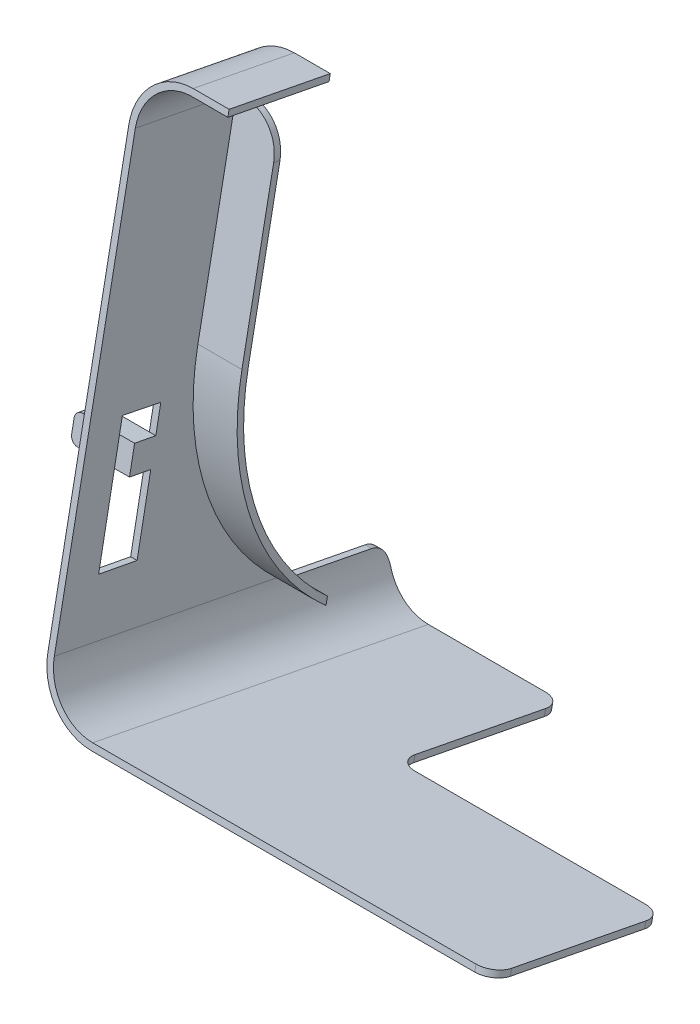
ISO-10303-21;
HEADER;
FILE_DESCRIPTION(('STEP AP214'),'2;1');
FILE_NAME('part.step','',(''),(''),'','','');
FILE_SCHEMA(('AUTOMOTIVE_DESIGN { 1 0 10303 214 1 1 1 1 }'));
ENDSEC;
DATA;
#1=APPLICATION_CONTEXT('core data for automotive mechanical design processes');
#2=APPLICATION_PROTOCOL_DEFINITION('international standard','automotive_design',2000,#1);
#3=PRODUCT_CONTEXT('',#1,'mechanical');
#4=PRODUCT('Part','Part','',(#3));
#5=PRODUCT_RELATED_PRODUCT_CATEGORY('part','',(#4));
#6=PRODUCT_DEFINITION_FORMATION('','',#4);
#7=PRODUCT_DEFINITION_CONTEXT('part definition',#1,'design');
#8=PRODUCT_DEFINITION('design','',#6,#7);
#9=PRODUCT_DEFINITION_SHAPE('','',#8);
#10=(LENGTH_UNIT() NAMED_UNIT(*) SI_UNIT(.MILLI.,.METRE.));
#11=(NAMED_UNIT(*) PLANE_ANGLE_UNIT() SI_UNIT($,.RADIAN.));
#12=(NAMED_UNIT(*) SI_UNIT($,.STERADIAN.) SOLID_ANGLE_UNIT());
#13=UNCERTAINTY_MEASURE_WITH_UNIT(LENGTH_MEASURE(1.E-05),#10,'distance_accuracy_value','');
#14=(GEOMETRIC_REPRESENTATION_CONTEXT(3) GLOBAL_UNCERTAINTY_ASSIGNED_CONTEXT((#13)) GLOBAL_UNIT_ASSIGNED_CONTEXT((#10,
#11,#12)) REPRESENTATION_CONTEXT('',''));
#15=CARTESIAN_POINT('',(0.,0.,0.));
#16=DIRECTION('',(0.,0.,1.));
#17=DIRECTION('',(1.,0.,0.));
#18=AXIS2_PLACEMENT_3D('',#15,#16,#17);
#19=CARTESIAN_POINT('',(-749.228152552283,-510.132186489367,-379.340241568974));
#20=DIRECTION('',(0.,-0.185955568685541,-0.982558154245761));
#21=DIRECTION('',(0.,0.982558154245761,-0.185955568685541));
#22=AXIS2_PLACEMENT_3D('',#19,#20,#21);
#23=PLANE('',#22);
#24=DIRECTION('',(1.,0.,0.));
#25=VECTOR('',#24,1.);
#26=CARTESIAN_POINT('',(-749.228152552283,-484.747030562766,-384.144548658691));
#27=LINE('',#26,#25);
#28=CARTESIAN_POINT('',(-909.883152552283,-484.747030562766,-384.144548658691));
#29=VERTEX_POINT('',#28);
#30=CARTESIAN_POINT('',(-907.597152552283,-484.747030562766,-384.144548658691));
#31=VERTEX_POINT('',#30);
#32=EDGE_CURVE('E11',#29,#31,#27,.T.);
#33=ORIENTED_EDGE('',*,*,#32,.F.);
#34=DIRECTION('',(0.,-0.982558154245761,0.185955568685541));
#35=VECTOR('',#34,1.);
#36=CARTESIAN_POINT('',(-909.883152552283,-510.132186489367,-379.340241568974));
#37=LINE('',#36,#35);
#38=CARTESIAN_POINT('',(-909.883152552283,-510.132186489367,-379.340241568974));
#39=VERTEX_POINT('',#38);
#40=EDGE_CURVE('E346',#29,#39,#37,.T.);
#41=ORIENTED_EDGE('',*,*,#40,.T.);
#42=DIRECTION('',(-1.,0.,0.));
#43=VECTOR('',#42,1.);
#44=CARTESIAN_POINT('',(-749.228152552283,-510.132186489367,-379.340241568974));
#45=LINE('',#44,#43);
#46=CARTESIAN_POINT('',(-907.597152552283,-510.132186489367,-379.340241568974));
#47=VERTEX_POINT('',#46);
#48=EDGE_CURVE('E362',#47,#39,#45,.T.);
#49=ORIENTED_EDGE('',*,*,#48,.F.);
#50=DIRECTION('',(0.,0.982558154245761,-0.185955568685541));
#51=VECTOR('',#50,1.);
#52=CARTESIAN_POINT('',(-907.597152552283,-382.408362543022,-403.512812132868));
#53=LINE('',#52,#51);
#54=EDGE_CURVE('E367',#47,#31,#53,.T.);
#55=ORIENTED_EDGE('',*,*,#54,.T.);
#56=EDGE_LOOP('',(#33,#41,#49,#55));
#57=FACE_BOUND('',#56,.T.);
#58=ADVANCED_FACE('F36',(#57),#23,.F.);
#59=DIRECTION('',(-1.,0.,0.));
#60=VECTOR('',#59,1.);
#61=CARTESIAN_POINT('',(-907.597152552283,-475.293050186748,-385.933776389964));
#62=LINE('',#61,#60);
#63=CARTESIAN_POINT('',(-907.597152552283,-475.293050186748,-385.933776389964));
#64=VERTEX_POINT('',#63);
#65=CARTESIAN_POINT('',(-909.883152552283,-475.293050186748,-385.933776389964));
#66=VERTEX_POINT('',#65);
#67=EDGE_CURVE('E58',#64,#66,#62,.T.);
#68=ORIENTED_EDGE('',*,*,#67,.F.);
#69=CARTESIAN_POINT('',(-907.597152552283,-465.986855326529,-387.69503474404));
#70=VERTEX_POINT('',#69);
#71=EDGE_CURVE('E359',#64,#70,#53,.T.);
#72=ORIENTED_EDGE('',*,*,#71,.T.);
#73=DIRECTION('',(-1.,0.,0.));
#74=VECTOR('',#73,1.);
#75=CARTESIAN_POINT('',(-749.228152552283,-465.986855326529,-387.69503474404));
#76=LINE('',#75,#74);
#77=CARTESIAN_POINT('',(-909.883152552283,-465.986855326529,-387.69503474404));
#78=VERTEX_POINT('',#77);
#79=EDGE_CURVE('E356',#70,#78,#76,.T.);
#80=ORIENTED_EDGE('',*,*,#79,.T.);
#81=EDGE_CURVE('E347',#78,#66,#37,.T.);
#82=ORIENTED_EDGE('',*,*,#81,.T.);
#83=EDGE_LOOP('',(#68,#72,#80,#82));
#84=FACE_BOUND('',#83,.T.);
#85=ADVANCED_FACE('F794',(#84),#23,.F.);
#86=CARTESIAN_POINT('',(-904.763190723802,-397.120995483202,-411.990162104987));
#87=DIRECTION('',(0.,-0.19080899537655,-0.981627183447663));
#88=DIRECTION('',(0.,0.981627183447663,-0.19080899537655));
#89=AXIS2_PLACEMENT_3D('',#86,#87,#88);
#90=CYLINDRICAL_SURFACE('',#89,12.7);
#91=DIRECTION('',(0.,0.190808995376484,0.981627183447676));
#92=VECTOR('',#91,1.);
#93=CARTESIAN_POINT('',(-892.063190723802,-397.557184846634,-414.234161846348));
#94=LINE('',#93,#92);
#95=CARTESIAN_POINT('',(-892.063190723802,-397.557184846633,-414.234161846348));
#96=VERTEX_POINT('',#95);
#97=CARTESIAN_POINT('',(-892.063190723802,-397.120995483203,-411.990162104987));
#98=VERTEX_POINT('',#97);
#99=EDGE_CURVE('E384',#96,#98,#94,.T.);
#100=ORIENTED_EDGE('',*,*,#99,.F.);
#101=CARTESIAN_POINT('',(-904.763190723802,-397.557184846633,-414.234161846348));
#102=DIRECTION('',(0.,-0.19080899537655,-0.981627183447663));
#103=DIRECTION('',(0.,0.981627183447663,-0.19080899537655));
#104=AXIS2_PLACEMENT_3D('',#101,#102,#103);
#105=CIRCLE('',#104,12.7);
#106=CARTESIAN_POINT('',(-904.763190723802,-385.090519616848,-416.65743608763));
#107=VERTEX_POINT('',#106);
#108=EDGE_CURVE('E537',#107,#96,#105,.T.);
#109=ORIENTED_EDGE('',*,*,#108,.F.);
#110=DIRECTION('',(0.,-0.190808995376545,-0.981627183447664));
#111=VECTOR('',#110,1.);
#112=CARTESIAN_POINT('',(-904.763190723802,-389.016223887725,-436.853433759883));
#113=LINE('',#112,#111);
#114=CARTESIAN_POINT('',(-904.763190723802,-384.654330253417,-414.413436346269));
#115=VERTEX_POINT('',#114);
#116=EDGE_CURVE('E541',#107,#115,#113,.F.);
#117=ORIENTED_EDGE('',*,*,#116,.T.);
#118=CARTESIAN_POINT('',(-904.763190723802,-397.120995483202,-411.990162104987));
#119=DIRECTION('',(0.,-0.190808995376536,-0.981627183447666));
#120=DIRECTION('',(0.,0.981627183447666,-0.190808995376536));
#121=AXIS2_PLACEMENT_3D('',#118,#119,#120);
#122=CIRCLE('',#121,12.7);
#123=EDGE_CURVE('E376',#98,#115,#122,.F.);
#124=ORIENTED_EDGE('',*,*,#123,.F.);
#125=EDGE_LOOP('',(#100,#109,#117,#124));
#126=FACE_BOUND('',#125,.T.);
#127=ADVANCED_FACE('F638',(#126),#90,.T.);
#128=CARTESIAN_POINT('',(-909.843190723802,-365.954332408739,-418.048347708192));
#129=DIRECTION('',(0.,0.190808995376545,0.981627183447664));
#130=DIRECTION('',(0.,-0.981627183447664,0.190808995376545));
#131=AXIS2_PLACEMENT_3D('',#128,#129,#130);
#132=PLANE('',#131);
#133=ORIENTED_EDGE('',*,*,#123,.T.);
#134=DIRECTION('',(1.,0.,0.));
#135=VECTOR('',#134,1.);
#136=CARTESIAN_POINT('',(-900.953190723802,-384.654330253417,-414.413436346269));
#137=LINE('',#136,#135);
#138=CARTESIAN_POINT('',(-907.597152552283,-384.654330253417,-414.413436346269));
#139=VERTEX_POINT('',#138);
#140=EDGE_CURVE('E536',#115,#139,#137,.F.);
#141=ORIENTED_EDGE('',*,*,#140,.T.);
#142=DIRECTION('',(0.,0.981627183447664,-0.190808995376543));
#143=VECTOR('',#142,1.);
#144=CARTESIAN_POINT('',(-907.597152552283,-454.738577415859,-400.79043871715));
#145=LINE('',#144,#143);
#146=CARTESIAN_POINT('',(-907.597152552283,-454.738577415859,-400.79043871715));
#147=VERTEX_POINT('',#146);
#148=EDGE_CURVE('E385',#147,#139,#145,.T.);
#149=ORIENTED_EDGE('',*,*,#148,.F.);
#150=DIRECTION('',(-1.,0.,0.));
#151=VECTOR('',#150,1.);
#152=CARTESIAN_POINT('',(-909.843190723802,-454.738577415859,-400.790438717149));
#153=LINE('',#152,#151);
#154=CARTESIAN_POINT('',(-892.063190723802,-454.738577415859,-400.790438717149));
#155=VERTEX_POINT('',#154);
#156=EDGE_CURVE('E553',#155,#147,#153,.T.);
#157=ORIENTED_EDGE('',*,*,#156,.F.);
#158=DIRECTION('',(0.,-0.981627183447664,0.190808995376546));
#159=VECTOR('',#158,1.);
#160=CARTESIAN_POINT('',(-892.063190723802,-397.120995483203,-411.990162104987));
#161=LINE('',#160,#159);
#162=EDGE_CURVE('E381',#98,#155,#161,.T.);
#163=ORIENTED_EDGE('',*,*,#162,.F.);
#164=EDGE_LOOP('',(#133,#141,#149,#157,#163));
#165=FACE_BOUND('',#164,.T.);
#166=ADVANCED_FACE('F633',(#165),#132,.T.);
#167=CARTESIAN_POINT('',(-909.843190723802,-455.174766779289,-403.034438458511));
#168=DIRECTION('',(0.,-0.190808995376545,-0.981627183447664));
#169=DIRECTION('',(0.,0.981627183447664,-0.190808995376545));
#170=AXIS2_PLACEMENT_3D('',#167,#168,#169);
#171=PLANE('',#170);
#172=DIRECTION('',(0.,0.981627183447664,-0.190808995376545));
#173=VECTOR('',#172,1.);
#174=CARTESIAN_POINT('',(-909.843190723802,-455.174766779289,-403.034438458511));
#175=LINE('',#174,#173);
#176=CARTESIAN_POINT('',(-909.843190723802,-455.174766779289,-403.034438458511));
#177=VERTEX_POINT('',#176);
#178=CARTESIAN_POINT('',(-909.843190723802,-385.090519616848,-416.65743608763));
#179=VERTEX_POINT('',#178);
#180=EDGE_CURVE('E408',#177,#179,#175,.T.);
#181=ORIENTED_EDGE('',*,*,#180,.T.);
#182=DIRECTION('',(1.,0.,0.));
#183=VECTOR('',#182,1.);
#184=CARTESIAN_POINT('',(-900.953190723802,-385.090519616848,-416.65743608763));
#185=LINE('',#184,#183);
#186=EDGE_CURVE('E538',#179,#107,#185,.T.);
#187=ORIENTED_EDGE('',*,*,#186,.T.);
#188=ORIENTED_EDGE('',*,*,#108,.T.);
#189=DIRECTION('',(0.,0.981627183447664,-0.190808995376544));
#190=VECTOR('',#189,1.);
#191=CARTESIAN_POINT('',(-892.063190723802,-455.174766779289,-403.034438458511));
#192=LINE('',#191,#190);
#193=CARTESIAN_POINT('',(-892.063190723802,-455.174766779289,-403.034438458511));
#194=VERTEX_POINT('',#193);
#195=EDGE_CURVE('E377',#194,#96,#192,.T.);
#196=ORIENTED_EDGE('',*,*,#195,.F.);
#197=DIRECTION('',(1.,0.,0.));
#198=VECTOR('',#197,1.);
#199=CARTESIAN_POINT('',(-909.843190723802,-455.174766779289,-403.034438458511));
#200=LINE('',#199,#198);
#201=EDGE_CURVE('E533',#194,#177,#200,.F.);
#202=ORIENTED_EDGE('',*,*,#201,.T.);
#203=EDGE_LOOP('',(#181,#187,#188,#196,#202));
#204=FACE_BOUND('',#203,.T.);
#205=ADVANCED_FACE('F777',(#204),#171,.T.);
#206=CARTESIAN_POINT('',(-900.953190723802,-389.016223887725,-436.853433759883));
#207=DIRECTION('',(0.,-0.981627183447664,0.190808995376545));
#208=DIRECTION('',(0.,-0.190808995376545,-0.981627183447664));
#209=AXIS2_PLACEMENT_3D('',#206,#207,#208);
#210=PLANE('',#209);
#211=ORIENTED_EDGE('',*,*,#186,.F.);
#212=DIRECTION('',(0.,0.190808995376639,0.981627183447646));
#213=VECTOR('',#212,1.);
#214=CARTESIAN_POINT('',(-909.843190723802,-385.090519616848,-416.65743608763));
#215=LINE('',#214,#213);
#216=CARTESIAN_POINT('',(-909.843190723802,-384.654330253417,-414.413436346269));
#217=VERTEX_POINT('',#216);
#218=EDGE_CURVE('E410',#179,#217,#215,.T.);
#219=ORIENTED_EDGE('',*,*,#218,.T.);
#220=DIRECTION('',(1.,0.,0.));
#221=VECTOR('',#220,1.);
#222=CARTESIAN_POINT('',(-1005.13315255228,-384.654330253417,-414.413436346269));
#223=LINE('',#222,#221);
#224=EDGE_CURVE('E402',#217,#139,#223,.T.);
#225=ORIENTED_EDGE('',*,*,#224,.T.);
#226=ORIENTED_EDGE('',*,*,#140,.F.);
#227=ORIENTED_EDGE('',*,*,#116,.F.);
#228=EDGE_LOOP('',(#211,#219,#225,#226,#227));
#229=FACE_BOUND('',#228,.T.);
#230=ADVANCED_FACE('F641',(#229),#210,.F.);
#231=CARTESIAN_POINT('',(-892.063190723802,-539.084509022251,-430.970977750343));
#232=DIRECTION('',(1.,0.,0.));
#233=DIRECTION('',(0.,0.,-1.));
#234=AXIS2_PLACEMENT_3D('',#231,#232,#233);
#235=PLANE('',#234);
#236=CARTESIAN_POINT('',(-892.063190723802,-472.354550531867,-491.416763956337));
#237=DIRECTION('',(-1.,0.,0.));
#238=DIRECTION('',(0.,0.,1.));
#239=AXIS2_PLACEMENT_3D('',#236,#237,#238);
#240=CIRCLE('',#239,90.0365505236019);
#241=CARTESIAN_POINT('',(-892.063190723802,-539.084509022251,-430.970977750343));
#242=VERTEX_POINT('',#241);
#243=EDGE_CURVE('E380',#194,#242,#240,.F.);
#244=ORIENTED_EDGE('',*,*,#243,.F.);
#245=ORIENTED_EDGE('',*,*,#195,.T.);
#246=ORIENTED_EDGE('',*,*,#99,.T.);
#247=ORIENTED_EDGE('',*,*,#162,.T.);
#248=CARTESIAN_POINT('',(-892.063190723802,-472.354550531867,-491.416763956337));
#249=DIRECTION('',(-1.,0.,0.));
#250=DIRECTION('',(0.,0.,1.));
#251=AXIS2_PLACEMENT_3D('',#248,#249,#250);
#252=CIRCLE('',#251,92.3225505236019);
#253=CARTESIAN_POINT('',(-892.063190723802,-541.69537613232,-430.46347659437));
#254=VERTEX_POINT('',#253);
#255=EDGE_CURVE('E389',#254,#155,#252,.T.);
#256=ORIENTED_EDGE('',*,*,#255,.F.);
#257=DIRECTION('',(0.,0.981627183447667,-0.190808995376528));
#258=VECTOR('',#257,1.);
#259=CARTESIAN_POINT('',(-892.063190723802,-541.69537613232,-430.46347659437));
#260=LINE('',#259,#258);
#261=EDGE_CURVE('E529',#242,#254,#260,.F.);
#262=ORIENTED_EDGE('',*,*,#261,.F.);
#263=EDGE_LOOP('',(#244,#245,#246,#247,#256,#262));
#264=FACE_BOUND('',#263,.T.);
#265=ADVANCED_FACE('F774',(#264),#235,.T.);
#266=CARTESIAN_POINT('',(-892.063190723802,-472.354550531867,-491.416763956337));
#267=DIRECTION('',(-1.,0.,0.));
#268=DIRECTION('',(0.,0.,1.));
#269=AXIS2_PLACEMENT_3D('',#266,#267,#268);
#270=CYLINDRICAL_SURFACE('',#269,90.0365505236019);
#271=DIRECTION('',(1.,0.,0.));
#272=VECTOR('',#271,1.);
#273=CARTESIAN_POINT('',(-909.843190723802,-539.084509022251,-430.970977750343));
#274=LINE('',#273,#272);
#275=CARTESIAN_POINT('',(-909.843190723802,-539.084509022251,-430.970977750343));
#276=VERTEX_POINT('',#275);
#277=EDGE_CURVE('E432',#276,#242,#274,.T.);
#278=ORIENTED_EDGE('',*,*,#277,.F.);
#279=CARTESIAN_POINT('',(-909.843190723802,-472.354550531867,-491.416763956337));
#280=DIRECTION('',(-1.,0.,0.));
#281=DIRECTION('',(0.,0.,1.));
#282=AXIS2_PLACEMENT_3D('',#279,#280,#281);
#283=CIRCLE('',#282,90.0365505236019);
#284=EDGE_CURVE('E411',#276,#177,#283,.T.);
#285=ORIENTED_EDGE('',*,*,#284,.T.);
#286=ORIENTED_EDGE('',*,*,#201,.F.);
#287=ORIENTED_EDGE('',*,*,#243,.T.);
#288=EDGE_LOOP('',(#278,#285,#286,#287));
#289=FACE_BOUND('',#288,.T.);
#290=ADVANCED_FACE('F781',(#289),#270,.F.);
#291=CARTESIAN_POINT('',(-749.228152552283,-541.276271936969,-346.91324069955));
#292=DIRECTION('',(1.,0.,0.));
#293=DIRECTION('',(0.,0.,-1.));
#294=AXIS2_PLACEMENT_3D('',#291,#292,#293);
#295=PLANE('',#294);
#296=DIRECTION('',(0.,-0.981627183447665,0.190808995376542));
#297=VECTOR('',#296,1.);
#298=CARTESIAN_POINT('',(-749.228152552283,-542.48790905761,-353.146573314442));
#299=LINE('',#298,#297);
#300=CARTESIAN_POINT('',(-749.228152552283,-542.48790905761,-353.146573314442));
#301=VERTEX_POINT('',#300);
#302=CARTESIAN_POINT('',(-749.228152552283,-544.731908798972,-352.710383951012));
#303=VERTEX_POINT('',#302);
#304=EDGE_CURVE('E523',#301,#303,#299,.T.);
#305=ORIENTED_EDGE('',*,*,#304,.T.);
#306=DIRECTION('',(0.,-0.190808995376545,-0.981627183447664));
#307=VECTOR('',#306,1.);
#308=CARTESIAN_POINT('',(-749.228152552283,-543.520271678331,-346.477051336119));
#309=LINE('',#308,#307);
#310=CARTESIAN_POINT('',(-749.228152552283,-553.940350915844,-400.083711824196));
#311=VERTEX_POINT('',#310);
#312=EDGE_CURVE('E420',#311,#303,#309,.F.);
#313=ORIENTED_EDGE('',*,*,#312,.F.);
#314=DIRECTION('',(0.,0.981627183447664,-0.190808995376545));
#315=VECTOR('',#314,1.);
#316=CARTESIAN_POINT('',(-749.228152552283,-540.351685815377,-402.725080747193));
#317=LINE('',#316,#315);
#318=CARTESIAN_POINT('',(-749.228152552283,-551.696351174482,-400.519901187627));
#319=VERTEX_POINT('',#318);
#320=EDGE_CURVE('E521',#319,#311,#317,.F.);
#321=ORIENTED_EDGE('',*,*,#320,.F.);
#322=DIRECTION('',(0.,0.190808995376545,0.981627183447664));
#323=VECTOR('',#322,1.);
#324=CARTESIAN_POINT('',(-749.228152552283,-541.276271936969,-346.91324069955));
#325=LINE('',#324,#323);
#326=EDGE_CURVE('E442',#301,#319,#325,.F.);
#327=ORIENTED_EDGE('',*,*,#326,.F.);
#328=EDGE_LOOP('',(#305,#313,#321,#327));
#329=FACE_BOUND('',#328,.T.);
#330=ADVANCED_FACE('F783',(#329),#295,.T.);
#331=CARTESIAN_POINT('',(-755.578152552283,-553.940350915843,-400.083711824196));
#332=DIRECTION('',(0.,0.981627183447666,-0.190808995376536));
#333=DIRECTION('',(0.,0.190808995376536,0.981627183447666));
#334=AXIS2_PLACEMENT_3D('',#331,#332,#333);
#335=CYLINDRICAL_SURFACE('',#334,6.35000000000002);
#336=DIRECTION('',(0.,0.981627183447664,-0.190808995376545));
#337=VECTOR('',#336,1.);
#338=CARTESIAN_POINT('',(-755.578152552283,-530.218657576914,-411.163592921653));
#339=LINE('',#338,#337);
#340=CARTESIAN_POINT('',(-755.578152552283,-552.907988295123,-406.753233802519));
#341=VERTEX_POINT('',#340);
#342=CARTESIAN_POINT('',(-755.578152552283,-555.151988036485,-406.317044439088));
#343=VERTEX_POINT('',#342);
#344=EDGE_CURVE('E518',#341,#343,#339,.F.);
#345=ORIENTED_EDGE('',*,*,#344,.F.);
#346=CARTESIAN_POINT('',(-755.578152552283,-551.696351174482,-400.519901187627));
#347=DIRECTION('',(0.,0.981627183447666,-0.190808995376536));
#348=DIRECTION('',(0.,0.190808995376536,0.981627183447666));
#349=AXIS2_PLACEMENT_3D('',#346,#347,#348);
#350=CIRCLE('',#349,6.35000000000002);
#351=EDGE_CURVE('E441',#319,#341,#350,.T.);
#352=ORIENTED_EDGE('',*,*,#351,.F.);
#353=ORIENTED_EDGE('',*,*,#320,.T.);
#354=CARTESIAN_POINT('',(-755.578152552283,-553.940350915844,-400.083711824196));
#355=DIRECTION('',(0.,0.981627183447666,-0.190808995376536));
#356=DIRECTION('',(0.,0.190808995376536,0.981627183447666));
#357=AXIS2_PLACEMENT_3D('',#354,#355,#356);
#358=CIRCLE('',#357,6.35000000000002);
#359=EDGE_CURVE('E424',#343,#311,#358,.F.);
#360=ORIENTED_EDGE('',*,*,#359,.F.);
#361=EDGE_LOOP('',(#345,#352,#353,#360));
#362=FACE_BOUND('',#361,.T.);
#363=ADVANCED_FACE('F789',(#362),#335,.T.);
#364=CARTESIAN_POINT('',(-792.408152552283,-530.218657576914,-411.163592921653));
#365=DIRECTION('',(0.,-0.190808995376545,-0.981627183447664));
#366=DIRECTION('',(0.,0.981627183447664,-0.190808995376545));
#367=AXIS2_PLACEMENT_3D('',#364,#365,#366);
#368=PLANE('',#367);
#369=ORIENTED_EDGE('',*,*,#344,.T.);
#370=DIRECTION('',(1.,0.,0.));
#371=VECTOR('',#370,1.);
#372=CARTESIAN_POINT('',(-749.228152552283,-555.151988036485,-406.317044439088));
#373=LINE('',#372,#371);
#374=CARTESIAN_POINT('',(-836.858152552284,-555.151988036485,-406.317044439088));
#375=VERTEX_POINT('',#374);
#376=EDGE_CURVE('E425',#375,#343,#373,.T.);
#377=ORIENTED_EDGE('',*,*,#376,.F.);
#378=DIRECTION('',(0.,0.981627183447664,-0.190808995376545));
#379=VECTOR('',#378,1.);
#380=CARTESIAN_POINT('',(-836.858152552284,-530.218657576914,-411.163592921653));
#381=LINE('',#380,#379);
#382=CARTESIAN_POINT('',(-836.858152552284,-552.907988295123,-406.753233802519));
#383=VERTEX_POINT('',#382);
#384=EDGE_CURVE('E516',#383,#375,#381,.F.);
#385=ORIENTED_EDGE('',*,*,#384,.F.);
#386=DIRECTION('',(1.,0.,0.));
#387=VECTOR('',#386,1.);
#388=CARTESIAN_POINT('',(-890.833152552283,-552.907988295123,-406.753233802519));
#389=LINE('',#388,#387);
#390=EDGE_CURVE('E438',#341,#383,#389,.F.);
#391=ORIENTED_EDGE('',*,*,#390,.F.);
#392=EDGE_LOOP('',(#369,#377,#385,#391));
#393=FACE_BOUND('',#392,.T.);
#394=ADVANCED_FACE('F847',(#393),#368,.T.);
#395=CARTESIAN_POINT('',(-836.858152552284,-556.363625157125,-412.550377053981));
#396=DIRECTION('',(0.,0.981627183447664,-0.190808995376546));
#397=DIRECTION('',(0.,0.190808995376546,0.981627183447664));
#398=AXIS2_PLACEMENT_3D('',#395,#396,#397);
#399=CYLINDRICAL_SURFACE('',#398,6.35000000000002);
#400=DIRECTION('',(0.,-0.981627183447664,0.190808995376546));
#401=VECTOR('',#400,1.);
#402=CARTESIAN_POINT('',(-843.208152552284,-554.119625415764,-412.986566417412));
#403=LINE('',#402,#401);
#404=CARTESIAN_POINT('',(-843.208152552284,-554.119625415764,-412.986566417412));
#405=VERTEX_POINT('',#404);
#406=CARTESIAN_POINT('',(-843.208152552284,-556.363625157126,-412.550377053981));
#407=VERTEX_POINT('',#406);
#408=EDGE_CURVE('E513',#405,#407,#403,.T.);
#409=ORIENTED_EDGE('',*,*,#408,.F.);
#410=CARTESIAN_POINT('',(-836.858152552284,-554.119625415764,-412.986566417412));
#411=DIRECTION('',(0.,0.981627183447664,-0.190808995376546));
#412=DIRECTION('',(0.,0.190808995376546,0.981627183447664));
#413=AXIS2_PLACEMENT_3D('',#410,#411,#412);
#414=CIRCLE('',#413,6.35000000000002);
#415=EDGE_CURVE('E437',#383,#405,#414,.F.);
#416=ORIENTED_EDGE('',*,*,#415,.F.);
#417=ORIENTED_EDGE('',*,*,#384,.T.);
#418=CARTESIAN_POINT('',(-836.858152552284,-556.363625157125,-412.550377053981));
#419=DIRECTION('',(0.,0.981627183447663,-0.190808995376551));
#420=DIRECTION('',(0.,0.190808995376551,0.981627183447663));
#421=AXIS2_PLACEMENT_3D('',#418,#419,#420);
#422=CIRCLE('',#421,6.35000000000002);
#423=EDGE_CURVE('E428',#407,#375,#422,.T.);
#424=ORIENTED_EDGE('',*,*,#423,.F.);
#425=EDGE_LOOP('',(#409,#416,#417,#424));
#426=FACE_BOUND('',#425,.T.);
#427=ADVANCED_FACE('F858',(#426),#399,.F.);
#428=CARTESIAN_POINT('',(-843.208152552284,-539.911754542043,-461.030253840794));
#429=DIRECTION('',(1.,0.,0.));
#430=DIRECTION('',(0.,1.,0.));
#431=AXIS2_PLACEMENT_3D('',#428,#429,#430);
#432=PLANE('',#431);
#433=ORIENTED_EDGE('',*,*,#408,.T.);
#434=DIRECTION('',(0.,-0.190808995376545,-0.981627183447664));
#435=VECTOR('',#434,1.);
#436=CARTESIAN_POINT('',(-843.208152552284,-543.520271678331,-346.477051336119));
#437=LINE('',#436,#435);
#438=CARTESIAN_POINT('',(-843.208152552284,-565.32973984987,-458.677038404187));
#439=VERTEX_POINT('',#438);
#440=EDGE_CURVE('E429',#439,#407,#437,.F.);
#441=ORIENTED_EDGE('',*,*,#440,.F.);
#442=DIRECTION('',(0.,-0.981627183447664,0.190808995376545));
#443=VECTOR('',#442,1.);
#444=CARTESIAN_POINT('',(-843.208152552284,-552.863074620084,-461.100312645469));
#445=LINE('',#444,#443);
#446=CARTESIAN_POINT('',(-843.208152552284,-563.085740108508,-459.113227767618));
#447=VERTEX_POINT('',#446);
#448=EDGE_CURVE('E510',#447,#439,#445,.T.);
#449=ORIENTED_EDGE('',*,*,#448,.F.);
#450=DIRECTION('',(0.,0.190808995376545,0.981627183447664));
#451=VECTOR('',#450,1.);
#452=CARTESIAN_POINT('',(-843.208152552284,-541.276271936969,-346.91324069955));
#453=LINE('',#452,#451);
#454=EDGE_CURVE('E433',#405,#447,#453,.F.);
#455=ORIENTED_EDGE('',*,*,#454,.F.);
#456=EDGE_LOOP('',(#433,#441,#449,#455));
#457=FACE_BOUND('',#456,.T.);
#458=ADVANCED_FACE('F869',(#457),#432,.T.);
#459=CARTESIAN_POINT('',(-892.063190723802,-472.354550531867,-491.416763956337));
#460=DIRECTION('',(-1.,0.,0.));
#461=DIRECTION('',(0.,0.,1.));
#462=AXIS2_PLACEMENT_3D('',#459,#460,#461);
#463=CYLINDRICAL_SURFACE('',#462,92.3225505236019);
#464=DIRECTION('',(1.,0.,0.));
#465=VECTOR('',#464,1.);
#466=CARTESIAN_POINT('',(-909.843190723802,-541.69537613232,-430.46347659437));
#467=LINE('',#466,#465);
#468=CARTESIAN_POINT('',(-907.551727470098,-541.69537613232,-430.46347659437));
#469=VERTEX_POINT('',#468);
#470=EDGE_CURVE('E532',#254,#469,#467,.F.);
#471=ORIENTED_EDGE('',*,*,#470,.F.);
#472=ORIENTED_EDGE('',*,*,#255,.T.);
#473=ORIENTED_EDGE('',*,*,#156,.T.);
#474=CARTESIAN_POINT('',(-907.597152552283,-472.354550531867,-491.416763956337));
#475=DIRECTION('',(-1.,0.,0.));
#476=DIRECTION('',(0.,0.,1.));
#477=AXIS2_PLACEMENT_3D('',#474,#475,#476);
#478=CIRCLE('',#477,92.3225505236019);
#479=CARTESIAN_POINT('',(-907.597152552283,-540.094035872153,-428.688656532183));
#480=VERTEX_POINT('',#479);
#481=EDGE_CURVE('E388',#480,#147,#478,.T.);
#482=ORIENTED_EDGE('',*,*,#481,.F.);
#483=CARTESIAN_POINT('',(-907.551727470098,-541.69537613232,-430.46347659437));
#484=CARTESIAN_POINT('',(-907.555485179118,-541.628748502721,-430.387680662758));
#485=CARTESIAN_POINT('',(-907.559019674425,-541.561991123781,-430.311987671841));
#486=CARTESIAN_POINT('',(-907.565622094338,-541.4284769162,-430.161101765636));
#487=CARTESIAN_POINT('',(-907.568691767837,-541.361721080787,-430.085908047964));
#488=CARTESIAN_POINT('',(-907.574362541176,-541.228214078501,-429.936019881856));
#489=CARTESIAN_POINT('',(-907.576965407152,-541.161463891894,-429.861324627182));
#490=CARTESIAN_POINT('',(-907.581700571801,-541.027972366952,-429.712432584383));
#491=CARTESIAN_POINT('',(-907.583834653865,-540.961231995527,-429.638234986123));
#492=CARTESIAN_POINT('',(-907.587630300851,-540.827764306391,-429.490337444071));
#493=CARTESIAN_POINT('',(-907.589293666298,-540.761037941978,-429.416636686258));
#494=CARTESIAN_POINT('',(-907.592145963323,-540.627602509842,-429.269732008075));
#495=CARTESIAN_POINT('',(-907.593336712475,-540.560894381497,-429.196527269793));
#496=CARTESIAN_POINT('',(-907.595241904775,-540.427499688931,-429.050613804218));
#497=CARTESIAN_POINT('',(-907.595958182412,-540.360814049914,-428.977904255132));
#498=CARTESIAN_POINT('',(-907.596912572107,-540.227468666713,-428.8329803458));
#499=CARTESIAN_POINT('',(-907.597152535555,-540.16080983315,-428.760765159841));
#500=CARTESIAN_POINT('',(-907.597152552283,-540.094035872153,-428.688656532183));
#501=B_SPLINE_CURVE_WITH_KNOTS('',3,(#483,#484,#485,#486,#487,#488,#489,#490,#491,#492,#493,
#494,#495,#496,#497,#498,#499,#500),.UNSPECIFIED.,.F.,.F.,(4,2,2,2,2,2,2,2,4),(0.,
0.302960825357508,0.604751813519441,0.905375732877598,1.20483538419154,1.5031336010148,
1.80027325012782,2.09625723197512,2.39108848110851),.UNSPECIFIED.);
#502=EDGE_CURVE('E464',#469,#480,#501,.T.);
#503=ORIENTED_EDGE('',*,*,#502,.F.);
#504=EDGE_LOOP('',(#471,#472,#473,#482,#503));
#505=FACE_BOUND('',#504,.T.);
#506=ADVANCED_FACE('F772',(#505),#463,.T.);
#507=CARTESIAN_POINT('',(-755.578152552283,-544.731908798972,-352.710383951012));
#508=DIRECTION('',(0.,0.981627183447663,-0.190808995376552));
#509=DIRECTION('',(0.,0.190808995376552,0.981627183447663));
#510=AXIS2_PLACEMENT_3D('',#507,#508,#509);
#511=CYLINDRICAL_SURFACE('',#510,6.35000000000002);
#512=DIRECTION('',(0.,-0.981627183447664,0.190808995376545));
#513=VECTOR('',#512,1.);
#514=CARTESIAN_POINT('',(-755.578152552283,-451.266948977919,-364.409280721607));
#515=LINE('',#514,#513);
#516=CARTESIAN_POINT('',(-755.578152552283,-543.520271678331,-346.477051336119));
#517=VERTEX_POINT('',#516);
#518=CARTESIAN_POINT('',(-755.578152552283,-541.276271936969,-346.91324069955));
#519=VERTEX_POINT('',#518);
#520=EDGE_CURVE('E478',#517,#519,#515,.F.);
#521=ORIENTED_EDGE('',*,*,#520,.F.);
#522=CARTESIAN_POINT('',(-755.578152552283,-544.731908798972,-352.710383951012));
#523=DIRECTION('',(0.,0.981627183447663,-0.190808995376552));
#524=DIRECTION('',(0.,0.190808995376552,0.981627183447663));
#525=AXIS2_PLACEMENT_3D('',#522,#523,#524);
#526=CIRCLE('',#525,6.35000000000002);
#527=EDGE_CURVE('E423',#303,#517,#526,.F.);
#528=ORIENTED_EDGE('',*,*,#527,.F.);
#529=ORIENTED_EDGE('',*,*,#304,.F.);
#530=CARTESIAN_POINT('',(-755.578152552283,-542.48790905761,-353.146573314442));
#531=DIRECTION('',(0.,0.981627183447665,-0.190808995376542));
#532=DIRECTION('',(0.,0.190808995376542,0.981627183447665));
#533=AXIS2_PLACEMENT_3D('',#530,#531,#532);
#534=CIRCLE('',#533,6.35000000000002);
#535=EDGE_CURVE('E445',#519,#301,#534,.T.);
#536=ORIENTED_EDGE('',*,*,#535,.F.);
#537=EDGE_LOOP('',(#521,#528,#529,#536));
#538=FACE_BOUND('',#537,.T.);
#539=ADVANCED_FACE('F765',(#538),#511,.T.);
#540=CARTESIAN_POINT('',(-907.597152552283,-377.713624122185,-378.706598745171));
#541=DIRECTION('',(1.,0.,0.));
#542=DIRECTION('',(0.,0.,-1.));
#543=AXIS2_PLACEMENT_3D('',#540,#541,#542);
#544=PLANE('',#543);
#545=DIRECTION('',(0.,0.199525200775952,0.979892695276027));
#546=VECTOR('',#545,1.);
#547=CARTESIAN_POINT('',(-907.597152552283,-460.715312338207,-361.805841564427));
#548=LINE('',#547,#546);
#549=CARTESIAN_POINT('',(-907.597152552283,-463.226576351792,-374.138966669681));
#550=VERTEX_POINT('',#549);
#551=EDGE_CURVE('E374',#70,#550,#548,.T.);
#552=ORIENTED_EDGE('',*,*,#551,.F.);
#553=ORIENTED_EDGE('',*,*,#71,.F.);
#554=DIRECTION('',(0.,-0.185955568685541,-0.982558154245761));
#555=VECTOR('',#554,1.);
#556=CARTESIAN_POINT('',(-907.597152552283,-473.876068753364,-378.446683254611));
#557=LINE('',#556,#555);
#558=CARTESIAN_POINT('',(-907.597152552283,-473.876068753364,-378.446683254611));
#559=VERTEX_POINT('',#558);
#560=EDGE_CURVE('E307',#559,#64,#557,.T.);
#561=ORIENTED_EDGE('',*,*,#560,.F.);
#562=DIRECTION('',(0.,0.982558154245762,-0.185955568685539));
#563=VECTOR('',#562,1.);
#564=CARTESIAN_POINT('',(-907.597152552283,-483.330049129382,-376.657455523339));
#565=LINE('',#564,#563);
#566=CARTESIAN_POINT('',(-907.597152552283,-483.330049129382,-376.657455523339));
#567=VERTEX_POINT('',#566);
#568=EDGE_CURVE('E324',#567,#559,#565,.T.);
#569=ORIENTED_EDGE('',*,*,#568,.F.);
#570=DIRECTION('',(0.,-0.185955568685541,-0.982558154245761));
#571=VECTOR('',#570,1.);
#572=CARTESIAN_POINT('',(-907.597152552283,-483.330049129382,-376.657455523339));
#573=LINE('',#572,#571);
#574=EDGE_CURVE('E341',#567,#31,#573,.T.);
#575=ORIENTED_EDGE('',*,*,#574,.T.);
#576=ORIENTED_EDGE('',*,*,#54,.F.);
#577=DIRECTION('',(0.,-0.185955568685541,-0.982558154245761));
#578=VECTOR('',#577,1.);
#579=CARTESIAN_POINT('',(-907.597152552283,-505.43744806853,-354.534028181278));
#580=LINE('',#579,#578);
#581=CARTESIAN_POINT('',(-907.597152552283,-507.559879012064,-365.748598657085));
#582=VERTEX_POINT('',#581);
#583=EDGE_CURVE('E369',#582,#47,#580,.T.);
#584=ORIENTED_EDGE('',*,*,#583,.F.);
#585=DIRECTION('',(0.,-0.982558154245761,0.185955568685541));
#586=VECTOR('',#585,1.);
#587=CARTESIAN_POINT('',(-907.597152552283,-379.836055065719,-389.921169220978));
#588=LINE('',#587,#586);
#589=EDGE_CURVE('E372',#550,#582,#588,.T.);
#590=ORIENTED_EDGE('',*,*,#589,.F.);
#591=EDGE_LOOP('',(#552,#553,#561,#569,#575,#576,#584,#590));
#592=FACE_BOUND('',#591,.T.);
#593=DIRECTION('',(0.,0.190808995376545,0.981627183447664));
#594=VECTOR('',#593,1.);
#595=CARTESIAN_POINT('',(-907.597152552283,-524.820273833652,-350.111962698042));
#596=LINE('',#595,#594);
#597=CARTESIAN_POINT('',(-907.597152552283,-524.820273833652,-350.111962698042));
#598=VERTEX_POINT('',#597);
#599=EDGE_CURVE('E508',#480,#598,#596,.T.);
#600=ORIENTED_EDGE('',*,*,#599,.F.);
#601=ORIENTED_EDGE('',*,*,#481,.T.);
#602=ORIENTED_EDGE('',*,*,#148,.T.);
#603=DIRECTION('',(0.,0.190808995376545,0.981627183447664));
#604=VECTOR('',#603,1.);
#605=CARTESIAN_POINT('',(-907.597152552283,-377.713624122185,-378.706598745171));
#606=LINE('',#605,#604);
#607=CARTESIAN_POINT('',(-907.597152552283,-377.713624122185,-378.706598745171));
#608=VERTEX_POINT('',#607);
#609=EDGE_CURVE('E505',#608,#139,#606,.F.);
#610=ORIENTED_EDGE('',*,*,#609,.F.);
#611=DIRECTION('',(0.,-0.981627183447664,0.190808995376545));
#612=VECTOR('',#611,1.);
#613=CARTESIAN_POINT('',(-907.597152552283,-451.266948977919,-364.409280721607));
#614=LINE('',#613,#612);
#615=EDGE_CURVE('E600',#598,#608,#614,.F.);
#616=ORIENTED_EDGE('',*,*,#615,.F.);
#617=EDGE_LOOP('',(#600,#601,#602,#610,#616));
#618=FACE_BOUND('',#617,.T.);
#619=ADVANCED_FACE('F652',(#592,#618),#544,.T.);
#620=CARTESIAN_POINT('',(-890.833152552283,-384.654330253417,-414.413436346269));
#621=DIRECTION('',(0.,0.190808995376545,0.981627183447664));
#622=DIRECTION('',(0.,-0.981627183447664,0.190808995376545));
#623=AXIS2_PLACEMENT_3D('',#620,#621,#622);
#624=CYLINDRICAL_SURFACE('',#623,16.764);
#625=DIRECTION('',(0.,-0.190808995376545,-0.981627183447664));
#626=VECTOR('',#625,1.);
#627=CARTESIAN_POINT('',(-890.833152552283,-361.257626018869,-381.905320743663));
#628=LINE('',#627,#626);
#629=CARTESIAN_POINT('',(-890.833152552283,-361.257626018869,-381.905320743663));
#630=VERTEX_POINT('',#629);
#631=CARTESIAN_POINT('',(-890.833152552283,-368.198332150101,-417.612158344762));
#632=VERTEX_POINT('',#631);
#633=EDGE_CURVE('E500',#630,#632,#628,.T.);
#634=ORIENTED_EDGE('',*,*,#633,.F.);
#635=CARTESIAN_POINT('',(-890.833152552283,-377.713624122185,-378.706598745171));
#636=DIRECTION('',(0.,0.190808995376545,0.981627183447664));
#637=DIRECTION('',(0.,-0.981627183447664,0.190808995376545));
#638=AXIS2_PLACEMENT_3D('',#635,#636,#637);
#639=CIRCLE('',#638,16.764);
#640=EDGE_CURVE('E597',#608,#630,#639,.F.);
#641=ORIENTED_EDGE('',*,*,#640,.F.);
#642=ORIENTED_EDGE('',*,*,#609,.T.);
#643=CARTESIAN_POINT('',(-890.833152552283,-384.654330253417,-414.413436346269));
#644=DIRECTION('',(0.,0.190808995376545,0.981627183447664));
#645=DIRECTION('',(0.,-0.981627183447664,0.190808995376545));
#646=AXIS2_PLACEMENT_3D('',#643,#644,#645);
#647=CIRCLE('',#646,16.764);
#648=EDGE_CURVE('E399',#139,#632,#647,.F.);
#649=ORIENTED_EDGE('',*,*,#648,.T.);
#650=EDGE_LOOP('',(#634,#641,#642,#649));
#651=FACE_BOUND('',#650,.T.);
#652=ADVANCED_FACE('F647',(#651),#624,.F.);
#653=CARTESIAN_POINT('',(-878.133152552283,-361.257626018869,-381.905320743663));
#654=DIRECTION('',(0.,-0.981627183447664,0.190808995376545));
#655=DIRECTION('',(0.,-0.190808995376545,-0.981627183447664));
#656=AXIS2_PLACEMENT_3D('',#653,#654,#655);
#657=PLANE('',#656);
#658=DIRECTION('',(1.,0.,0.));
#659=VECTOR('',#658,1.);
#660=CARTESIAN_POINT('',(-879.18731783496,-361.257626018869,-381.905320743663));
#661=LINE('',#660,#659);
#662=CARTESIAN_POINT('',(-878.133152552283,-361.257626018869,-381.905320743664));
#663=VERTEX_POINT('',#662);
#664=EDGE_CURVE('E495',#630,#663,#661,.T.);
#665=ORIENTED_EDGE('',*,*,#664,.F.);
#666=ORIENTED_EDGE('',*,*,#633,.T.);
#667=DIRECTION('',(1.,0.,0.));
#668=VECTOR('',#667,1.);
#669=CARTESIAN_POINT('',(-1005.13315255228,-368.198332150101,-417.612158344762));
#670=LINE('',#669,#668);
#671=CARTESIAN_POINT('',(-878.133152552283,-368.198332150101,-417.612158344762));
#672=VERTEX_POINT('',#671);
#673=EDGE_CURVE('E397',#632,#672,#670,.T.);
#674=ORIENTED_EDGE('',*,*,#673,.T.);
#675=DIRECTION('',(0.,-0.190808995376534,-0.981627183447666));
#676=VECTOR('',#675,1.);
#677=CARTESIAN_POINT('',(-878.133152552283,-361.257626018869,-381.905320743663));
#678=LINE('',#677,#676);
#679=EDGE_CURVE('E488',#663,#672,#678,.T.);
#680=ORIENTED_EDGE('',*,*,#679,.F.);
#681=EDGE_LOOP('',(#665,#666,#674,#680));
#682=FACE_BOUND('',#681,.T.);
#683=ADVANCED_FACE('F753',(#682),#657,.T.);
#684=CARTESIAN_POINT('',(-878.133152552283,-359.013626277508,-382.341510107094));
#685=DIRECTION('',(1.,0.,0.));
#686=DIRECTION('',(0.,0.,-1.));
#687=AXIS2_PLACEMENT_3D('',#684,#685,#686);
#688=PLANE('',#687);
#689=DIRECTION('',(0.,-0.981627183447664,0.190808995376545));
#690=VECTOR('',#689,1.);
#691=CARTESIAN_POINT('',(-878.133152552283,-451.266948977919,-364.409280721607));
#692=LINE('',#691,#690);
#693=CARTESIAN_POINT('',(-878.133152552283,-359.013626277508,-382.341510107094));
#694=VERTEX_POINT('',#693);
#695=EDGE_CURVE('E491',#663,#694,#692,.F.);
#696=ORIENTED_EDGE('',*,*,#695,.F.);
#697=ORIENTED_EDGE('',*,*,#679,.T.);
#698=DIRECTION('',(0.,-0.981627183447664,0.190808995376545));
#699=VECTOR('',#698,1.);
#700=CARTESIAN_POINT('',(-878.133152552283,-365.954332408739,-418.048347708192));
#701=LINE('',#700,#699);
#702=CARTESIAN_POINT('',(-878.133152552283,-365.954332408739,-418.048347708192));
#703=VERTEX_POINT('',#702);
#704=EDGE_CURVE('E394',#672,#703,#701,.F.);
#705=ORIENTED_EDGE('',*,*,#704,.T.);
#706=DIRECTION('',(0.,0.190808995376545,0.981627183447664));
#707=VECTOR('',#706,1.);
#708=CARTESIAN_POINT('',(-878.133152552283,-359.013626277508,-382.341510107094));
#709=LINE('',#708,#707);
#710=EDGE_CURVE('E485',#694,#703,#709,.F.);
#711=ORIENTED_EDGE('',*,*,#710,.F.);
#712=EDGE_LOOP('',(#696,#697,#705,#711));
#713=FACE_BOUND('',#712,.T.);
#714=ADVANCED_FACE('F749',(#713),#688,.T.);
#715=CARTESIAN_POINT('',(-890.833152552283,-359.013626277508,-382.341510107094));
#716=DIRECTION('',(0.,0.981627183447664,-0.190808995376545));
#717=DIRECTION('',(0.,0.190808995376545,0.981627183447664));
#718=AXIS2_PLACEMENT_3D('',#715,#716,#717);
#719=PLANE('',#718);
#720=DIRECTION('',(1.,0.,0.));
#721=VECTOR('',#720,1.);
#722=CARTESIAN_POINT('',(-879.18731783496,-359.013626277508,-382.341510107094));
#723=LINE('',#722,#721);
#724=CARTESIAN_POINT('',(-890.833152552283,-359.013626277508,-382.341510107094));
#725=VERTEX_POINT('',#724);
#726=EDGE_CURVE('E494',#694,#725,#723,.F.);
#727=ORIENTED_EDGE('',*,*,#726,.F.);
#728=ORIENTED_EDGE('',*,*,#710,.T.);
#729=DIRECTION('',(1.,0.,0.));
#730=VECTOR('',#729,1.);
#731=CARTESIAN_POINT('',(-1005.13315255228,-365.954332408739,-418.048347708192));
#732=LINE('',#731,#730);
#733=CARTESIAN_POINT('',(-890.833152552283,-365.954332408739,-418.048347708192));
#734=VERTEX_POINT('',#733);
#735=EDGE_CURVE('E390',#703,#734,#732,.F.);
#736=ORIENTED_EDGE('',*,*,#735,.T.);
#737=DIRECTION('',(0.,0.190808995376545,0.981627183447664));
#738=VECTOR('',#737,1.);
#739=CARTESIAN_POINT('',(-890.833152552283,-359.013626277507,-382.341510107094));
#740=LINE('',#739,#738);
#741=EDGE_CURVE('E405',#725,#734,#740,.F.);
#742=ORIENTED_EDGE('',*,*,#741,.F.);
#743=EDGE_LOOP('',(#727,#728,#736,#742));
#744=FACE_BOUND('',#743,.T.);
#745=ADVANCED_FACE('F745',(#744),#719,.T.);
#746=CARTESIAN_POINT('',(-1005.13315255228,-365.954332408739,-418.048347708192));
#747=DIRECTION('',(0.,0.190808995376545,0.981627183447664));
#748=DIRECTION('',(0.,-0.981627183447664,0.190808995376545));
#749=AXIS2_PLACEMENT_3D('',#746,#747,#748);
#750=PLANE('',#749);
#751=DIRECTION('',(-1.,0.,0.));
#752=VECTOR('',#751,1.);
#753=CARTESIAN_POINT('',(-1005.13315255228,-454.738577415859,-400.79043871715));
#754=LINE('',#753,#752);
#755=CARTESIAN_POINT('',(-909.843190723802,-454.738577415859,-400.79043871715));
#756=VERTEX_POINT('',#755);
#757=CARTESIAN_POINT('',(-909.883152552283,-454.738577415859,-400.79043871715));
#758=VERTEX_POINT('',#757);
#759=EDGE_CURVE('E393',#756,#758,#754,.T.);
#760=ORIENTED_EDGE('',*,*,#759,.T.);
#761=DIRECTION('',(0.,-0.981627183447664,0.190808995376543));
#762=VECTOR('',#761,1.);
#763=CARTESIAN_POINT('',(-909.883152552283,-384.654330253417,-414.413436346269));
#764=LINE('',#763,#762);
#765=CARTESIAN_POINT('',(-909.883152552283,-384.654330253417,-414.413436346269));
#766=VERTEX_POINT('',#765);
#767=EDGE_CURVE('E663',#766,#758,#764,.T.);
#768=ORIENTED_EDGE('',*,*,#767,.F.);
#769=CARTESIAN_POINT('',(-890.833152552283,-384.654330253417,-414.413436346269));
#770=DIRECTION('',(0.,0.190808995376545,0.981627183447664));
#771=DIRECTION('',(0.,-0.981627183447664,0.190808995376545));
#772=AXIS2_PLACEMENT_3D('',#769,#770,#771);
#773=CIRCLE('',#772,19.05);
#774=EDGE_CURVE('E417',#734,#766,#773,.T.);
#775=ORIENTED_EDGE('',*,*,#774,.F.);
#776=ORIENTED_EDGE('',*,*,#735,.F.);
#777=ORIENTED_EDGE('',*,*,#704,.F.);
#778=ORIENTED_EDGE('',*,*,#673,.F.);
#779=ORIENTED_EDGE('',*,*,#648,.F.);
#780=ORIENTED_EDGE('',*,*,#224,.F.);
#781=DIRECTION('',(0.,-0.981627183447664,0.190808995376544));
#782=VECTOR('',#781,1.);
#783=CARTESIAN_POINT('',(-909.843190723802,-384.654330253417,-414.413436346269));
#784=LINE('',#783,#782);
#785=EDGE_CURVE('E414',#217,#756,#784,.T.);
#786=ORIENTED_EDGE('',*,*,#785,.T.);
#787=EDGE_LOOP('',(#760,#768,#775,#776,#777,#778,#779,#780,#786));
#788=FACE_BOUND('',#787,.T.);
#789=ADVANCED_FACE('F734',(#788),#750,.F.);
#790=CARTESIAN_POINT('',(-890.833152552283,-384.654330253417,-414.413436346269));
#791=DIRECTION('',(0.,0.190808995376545,0.981627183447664));
#792=DIRECTION('',(0.,-0.981627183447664,0.190808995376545));
#793=AXIS2_PLACEMENT_3D('',#790,#791,#792);
#794=CYLINDRICAL_SURFACE('',#793,19.05);
#795=DIRECTION('',(0.,-0.190808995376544,-0.981627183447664));
#796=VECTOR('',#795,1.);
#797=CARTESIAN_POINT('',(-909.883152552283,-377.713624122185,-378.706598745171));
#798=LINE('',#797,#796);
#799=CARTESIAN_POINT('',(-909.883152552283,-377.713624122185,-378.706598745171));
#800=VERTEX_POINT('',#799);
#801=EDGE_CURVE('E466',#800,#766,#798,.T.);
#802=ORIENTED_EDGE('',*,*,#801,.F.);
#803=CARTESIAN_POINT('',(-890.833152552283,-377.713624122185,-378.706598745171));
#804=DIRECTION('',(0.,0.190808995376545,0.981627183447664));
#805=DIRECTION('',(0.,-0.981627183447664,0.190808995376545));
#806=AXIS2_PLACEMENT_3D('',#803,#804,#805);
#807=CIRCLE('',#806,19.05);
#808=EDGE_CURVE('E595',#725,#800,#807,.T.);
#809=ORIENTED_EDGE('',*,*,#808,.F.);
#810=ORIENTED_EDGE('',*,*,#741,.T.);
#811=ORIENTED_EDGE('',*,*,#774,.T.);
#812=EDGE_LOOP('',(#802,#809,#810,#811));
#813=FACE_BOUND('',#812,.T.);
#814=ADVANCED_FACE('F739',(#813),#794,.T.);
#815=CARTESIAN_POINT('',(-909.843190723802,-465.750568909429,-414.203970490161));
#816=DIRECTION('',(1.,0.,0.));
#817=DIRECTION('',(0.,0.,-1.));
#818=AXIS2_PLACEMENT_3D('',#815,#816,#817);
#819=PLANE('',#818);
#820=ORIENTED_EDGE('',*,*,#180,.F.);
#821=ORIENTED_EDGE('',*,*,#284,.F.);
#822=DIRECTION('',(0.,0.981627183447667,-0.190808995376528));
#823=VECTOR('',#822,1.);
#824=CARTESIAN_POINT('',(-909.843190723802,-541.69537613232,-430.46347659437));
#825=LINE('',#824,#823);
#826=CARTESIAN_POINT('',(-909.843190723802,-541.69537613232,-430.46347659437));
#827=VERTEX_POINT('',#826);
#828=EDGE_CURVE('E528',#827,#276,#825,.T.);
#829=ORIENTED_EDGE('',*,*,#828,.F.);
#830=CARTESIAN_POINT('',(-909.843190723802,-472.354550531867,-491.416763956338));
#831=DIRECTION('',(-1.,0.,0.));
#832=DIRECTION('',(0.,0.,1.));
#833=AXIS2_PLACEMENT_3D('',#830,#831,#832);
#834=CIRCLE('',#833,92.3225505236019);
#835=EDGE_CURVE('E591',#827,#756,#834,.T.);
#836=ORIENTED_EDGE('',*,*,#835,.T.);
#837=ORIENTED_EDGE('',*,*,#785,.F.);
#838=ORIENTED_EDGE('',*,*,#218,.F.);
#839=EDGE_LOOP('',(#820,#821,#829,#836,#837,#838));
#840=FACE_BOUND('',#839,.T.);
#841=ADVANCED_FACE('F733',(#840),#819,.F.);
#842=CARTESIAN_POINT('',(-909.843190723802,-541.69537613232,-430.46347659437));
#843=DIRECTION('',(0.,-0.190808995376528,-0.981627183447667));
#844=DIRECTION('',(0.,0.981627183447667,-0.190808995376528));
#845=AXIS2_PLACEMENT_3D('',#842,#843,#844);
#846=PLANE('',#845);
#847=ORIENTED_EDGE('',*,*,#828,.T.);
#848=ORIENTED_EDGE('',*,*,#277,.T.);
#849=ORIENTED_EDGE('',*,*,#261,.T.);
#850=ORIENTED_EDGE('',*,*,#470,.T.);
#851=DIRECTION('',(1.,0.,0.));
#852=VECTOR('',#851,1.);
#853=CARTESIAN_POINT('',(-1005.13315255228,-541.69537613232,-430.46347659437));
#854=LINE('',#853,#852);
#855=EDGE_CURVE('E704',#469,#827,#854,.F.);
#856=ORIENTED_EDGE('',*,*,#855,.T.);
#857=EDGE_LOOP('',(#847,#848,#849,#850,#856));
#858=FACE_BOUND('',#857,.T.);
#859=ADVANCED_FACE('F715',(#858),#846,.T.);
#860=CARTESIAN_POINT('',(-749.228152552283,-543.520271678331,-346.477051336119));
#861=DIRECTION('',(0.,-0.981627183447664,0.190808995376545));
#862=DIRECTION('',(0.,-0.190808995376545,-0.981627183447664));
#863=AXIS2_PLACEMENT_3D('',#860,#861,#862);
#864=PLANE('',#863);
#865=DIRECTION('',(1.,0.,0.));
#866=VECTOR('',#865,1.);
#867=CARTESIAN_POINT('',(-749.228152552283,-566.541376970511,-464.91037101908));
#868=LINE('',#867,#866);
#869=CARTESIAN_POINT('',(-890.833152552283,-566.541376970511,-464.91037101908));
#870=VERTEX_POINT('',#869);
#871=CARTESIAN_POINT('',(-849.558152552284,-566.541376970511,-464.910371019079));
#872=VERTEX_POINT('',#871);
#873=EDGE_CURVE('E588',#870,#872,#868,.T.);
#874=ORIENTED_EDGE('',*,*,#873,.T.);
#875=CARTESIAN_POINT('',(-849.558152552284,-565.32973984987,-458.677038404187));
#876=DIRECTION('',(0.,-0.981627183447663,0.190808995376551));
#877=DIRECTION('',(0.,-0.190808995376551,-0.981627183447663));
#878=AXIS2_PLACEMENT_3D('',#875,#876,#877);
#879=CIRCLE('',#878,6.35000000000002);
#880=EDGE_CURVE('E612',#439,#872,#879,.F.);
#881=ORIENTED_EDGE('',*,*,#880,.F.);
#882=ORIENTED_EDGE('',*,*,#440,.T.);
#883=ORIENTED_EDGE('',*,*,#423,.T.);
#884=ORIENTED_EDGE('',*,*,#376,.T.);
#885=ORIENTED_EDGE('',*,*,#359,.T.);
#886=ORIENTED_EDGE('',*,*,#312,.T.);
#887=ORIENTED_EDGE('',*,*,#527,.T.);
#888=DIRECTION('',(1.,0.,0.));
#889=VECTOR('',#888,1.);
#890=CARTESIAN_POINT('',(-879.18731783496,-543.520271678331,-346.477051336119));
#891=LINE('',#890,#889);
#892=CARTESIAN_POINT('',(-890.833152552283,-543.520271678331,-346.477051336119));
#893=VERTEX_POINT('',#892);
#894=EDGE_CURVE('E448',#893,#517,#891,.T.);
#895=ORIENTED_EDGE('',*,*,#894,.F.);
#896=DIRECTION('',(0.,0.190808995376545,0.981627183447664));
#897=VECTOR('',#896,1.);
#898=CARTESIAN_POINT('',(-890.833152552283,-543.520271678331,-346.477051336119));
#899=LINE('',#898,#897);
#900=EDGE_CURVE('E482',#870,#893,#899,.T.);
#901=ORIENTED_EDGE('',*,*,#900,.F.);
#902=EDGE_LOOP('',(#874,#881,#882,#883,#884,#885,#886,#887,#895,#901));
#903=FACE_BOUND('',#902,.T.);
#904=ADVANCED_FACE('F762',(#903),#864,.T.);
#905=CARTESIAN_POINT('',(-849.558152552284,-563.085740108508,-459.113227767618));
#906=DIRECTION('',(0.,-0.981627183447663,0.190808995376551));
#907=DIRECTION('',(0.,-0.190808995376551,-0.981627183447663));
#908=AXIS2_PLACEMENT_3D('',#905,#906,#907);
#909=CYLINDRICAL_SURFACE('',#908,6.35000000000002);
#910=DIRECTION('',(0.,-0.981627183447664,0.190808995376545));
#911=VECTOR('',#910,1.);
#912=CARTESIAN_POINT('',(-849.558152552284,-566.541376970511,-464.91037101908));
#913=LINE('',#912,#911);
#914=CARTESIAN_POINT('',(-849.558152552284,-564.297377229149,-465.34656038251));
#915=VERTEX_POINT('',#914);
#916=EDGE_CURVE('E672',#872,#915,#913,.F.);
#917=ORIENTED_EDGE('',*,*,#916,.T.);
#918=CARTESIAN_POINT('',(-849.558152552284,-563.085740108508,-459.113227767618));
#919=DIRECTION('',(0.,-0.981627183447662,0.190808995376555));
#920=DIRECTION('',(0.,-0.190808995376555,-0.981627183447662));
#921=AXIS2_PLACEMENT_3D('',#918,#919,#920);
#922=CIRCLE('',#921,6.35000000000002);
#923=EDGE_CURVE('E436',#447,#915,#922,.F.);
#924=ORIENTED_EDGE('',*,*,#923,.F.);
#925=ORIENTED_EDGE('',*,*,#448,.T.);
#926=ORIENTED_EDGE('',*,*,#880,.T.);
#927=EDGE_LOOP('',(#917,#924,#925,#926));
#928=FACE_BOUND('',#927,.T.);
#929=ADVANCED_FACE('F1203',(#928),#909,.T.);
#930=CARTESIAN_POINT('',(-890.833152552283,-541.276271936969,-346.91324069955));
#931=DIRECTION('',(0.,0.981627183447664,-0.190808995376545));
#932=DIRECTION('',(0.,0.190808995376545,0.981627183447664));
#933=AXIS2_PLACEMENT_3D('',#930,#931,#932);
#934=PLANE('',#933);
#935=ORIENTED_EDGE('',*,*,#454,.T.);
#936=ORIENTED_EDGE('',*,*,#923,.T.);
#937=DIRECTION('',(1.,0.,0.));
#938=VECTOR('',#937,1.);
#939=CARTESIAN_POINT('',(-749.228152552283,-564.297377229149,-465.34656038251));
#940=LINE('',#939,#938);
#941=CARTESIAN_POINT('',(-890.833152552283,-564.297377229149,-465.34656038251));
#942=VERTEX_POINT('',#941);
#943=EDGE_CURVE('E669',#915,#942,#940,.F.);
#944=ORIENTED_EDGE('',*,*,#943,.T.);
#945=DIRECTION('',(0.,0.190808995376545,0.981627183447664));
#946=VECTOR('',#945,1.);
#947=CARTESIAN_POINT('',(-890.833152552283,-541.276271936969,-346.91324069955));
#948=LINE('',#947,#946);
#949=CARTESIAN_POINT('',(-890.833152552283,-541.276271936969,-346.91324069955));
#950=VERTEX_POINT('',#949);
#951=EDGE_CURVE('E605',#950,#942,#948,.F.);
#952=ORIENTED_EDGE('',*,*,#951,.F.);
#953=DIRECTION('',(1.,0.,0.));
#954=VECTOR('',#953,1.);
#955=CARTESIAN_POINT('',(-879.18731783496,-541.276271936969,-346.91324069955));
#956=LINE('',#955,#954);
#957=EDGE_CURVE('E481',#519,#950,#956,.F.);
#958=ORIENTED_EDGE('',*,*,#957,.F.);
#959=ORIENTED_EDGE('',*,*,#535,.T.);
#960=ORIENTED_EDGE('',*,*,#326,.T.);
#961=ORIENTED_EDGE('',*,*,#351,.T.);
#962=ORIENTED_EDGE('',*,*,#390,.T.);
#963=ORIENTED_EDGE('',*,*,#415,.T.);
#964=EDGE_LOOP('',(#935,#936,#944,#952,#958,#959,#960,#961,#962,#963));
#965=FACE_BOUND('',#964,.T.);
#966=ADVANCED_FACE('F454',(#965),#934,.T.);
#967=CARTESIAN_POINT('',(-890.833152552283,-547.841379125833,-468.545282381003));
#968=DIRECTION('',(0.,0.190808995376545,0.981627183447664));
#969=DIRECTION('',(0.,-0.981627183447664,0.190808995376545));
#970=AXIS2_PLACEMENT_3D('',#967,#968,#969);
#971=CYLINDRICAL_SURFACE('',#970,16.764);
#972=ORIENTED_EDGE('',*,*,#599,.T.);
#973=CARTESIAN_POINT('',(-890.833152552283,-524.820273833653,-350.111962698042));
#974=DIRECTION('',(0.,0.190808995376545,0.981627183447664));
#975=DIRECTION('',(0.,-0.981627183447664,0.190808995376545));
#976=AXIS2_PLACEMENT_3D('',#973,#974,#975);
#977=CIRCLE('',#976,16.764);
#978=EDGE_CURVE('E601',#950,#598,#977,.F.);
#979=ORIENTED_EDGE('',*,*,#978,.F.);
#980=ORIENTED_EDGE('',*,*,#951,.T.);
#981=CARTESIAN_POINT('',(-890.833152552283,-547.841379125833,-468.545282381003));
#982=DIRECTION('',(0.,0.190808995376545,0.981627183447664));
#983=DIRECTION('',(0.,-0.981627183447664,0.190808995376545));
#984=AXIS2_PLACEMENT_3D('',#981,#982,#983);
#985=CIRCLE('',#984,16.764);
#986=CARTESIAN_POINT('',(-905.783930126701,-555.285320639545,-467.098326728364));
#987=VERTEX_POINT('',#986);
#988=EDGE_CURVE('E590',#942,#987,#985,.F.);
#989=ORIENTED_EDGE('',*,*,#988,.T.);
#990=CARTESIAN_POINT('',(-907.551727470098,-547.840350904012,-462.076631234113));
#991=CARTESIAN_POINT('',(-907.551707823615,-547.874153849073,-462.250632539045));
#992=CARTESIAN_POINT('',(-907.551179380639,-547.915278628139,-462.423208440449));
#993=CARTESIAN_POINT('',(-907.548962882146,-548.011800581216,-462.764317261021));
#994=CARTESIAN_POINT('',(-907.547274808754,-548.067197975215,-462.932850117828));
#995=CARTESIAN_POINT('',(-907.542592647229,-548.192009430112,-463.264985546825));
#996=CARTESIAN_POINT('',(-907.539596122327,-548.261449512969,-463.428578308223));
#997=CARTESIAN_POINT('',(-907.532020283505,-548.413771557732,-463.749333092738));
#998=CARTESIAN_POINT('',(-907.527441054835,-548.496652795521,-463.90649546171));
#999=CARTESIAN_POINT('',(-907.516331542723,-548.675340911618,-464.213420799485));
#1000=CARTESIAN_POINT('',(-907.509799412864,-548.771159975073,-464.363176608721));
#1001=CARTESIAN_POINT('',(-907.494338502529,-548.974948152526,-464.654047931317));
#1002=CARTESIAN_POINT('',(-907.485409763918,-549.082917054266,-464.795163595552));
#1003=CARTESIAN_POINT('',(-907.464673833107,-549.309872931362,-465.067365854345));
#1004=CARTESIAN_POINT('',(-907.452874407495,-549.428829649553,-465.198478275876));
#1005=CARTESIAN_POINT('',(-907.425841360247,-549.677026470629,-465.450090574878));
#1006=CARTESIAN_POINT('',(-907.410609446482,-549.806261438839,-465.570595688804));
#1007=CARTESIAN_POINT('',(-907.381421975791,-550.033014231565,-465.765042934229));
#1008=CARTESIAN_POINT('',(-907.368501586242,-550.128139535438,-465.841951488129));
#1009=CARTESIAN_POINT('',(-907.340545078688,-550.322495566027,-465.990032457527));
#1010=CARTESIAN_POINT('',(-907.325508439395,-550.421727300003,-466.061203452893));
#1011=CARTESIAN_POINT('',(-907.286441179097,-550.665706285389,-466.225767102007));
#1012=CARTESIAN_POINT('',(-907.261263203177,-550.812300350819,-466.316172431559));
#1013=CARTESIAN_POINT('',(-907.205840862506,-551.111666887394,-466.484465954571));
#1014=CARTESIAN_POINT('',(-907.175594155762,-551.264442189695,-466.562348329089));
#1015=CARTESIAN_POINT('',(-907.109601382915,-551.575005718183,-466.705230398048));
#1016=CARTESIAN_POINT('',(-907.073848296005,-551.732800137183,-466.770213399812));
#1017=CARTESIAN_POINT('',(-906.996550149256,-552.05191171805,-466.88693877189));
#1018=CARTESIAN_POINT('',(-906.955002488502,-552.213230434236,-466.93867516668));
#1019=CARTESIAN_POINT('',(-906.866016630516,-552.537631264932,-467.02870459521));
#1020=CARTESIAN_POINT('',(-906.81858950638,-552.700709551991,-467.06702239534));
#1021=CARTESIAN_POINT('',(-906.717731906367,-553.027497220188,-467.130430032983));
#1022=CARTESIAN_POINT('',(-906.664303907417,-553.191206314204,-467.155525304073));
#1023=CARTESIAN_POINT('',(-906.551482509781,-553.518004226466,-467.192771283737));
#1024=CARTESIAN_POINT('',(-906.492089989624,-553.681093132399,-467.204923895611));
#1025=CARTESIAN_POINT('',(-906.367507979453,-554.00543855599,-467.216700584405));
#1026=CARTESIAN_POINT('',(-906.302320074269,-554.166695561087,-467.216328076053));
#1027=CARTESIAN_POINT('',(-906.164760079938,-554.490161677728,-467.203436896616));
#1028=CARTESIAN_POINT('',(-906.092253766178,-554.652301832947,-467.190628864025));
#1029=CARTESIAN_POINT('',(-905.941976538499,-554.972208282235,-467.153163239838));
#1030=CARTESIAN_POINT('',(-905.864219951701,-555.129984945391,-467.128536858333));
#1031=CARTESIAN_POINT('',(-905.783930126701,-555.285320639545,-467.098326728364));
#1032=B_SPLINE_CURVE_WITH_KNOTS('',3,(#990,#991,#992,#993,#994,#995,#996,#997,#998,#999,#1000,
#1001,#1002,#1003,#1004,#1005,#1006,#1007,#1008,#1009,#1010,#1011,#1012,#1013,#1014,#1015,#1016,
#1017,#1018,#1019,#1020,#1021,#1022,#1023,#1024,#1025,#1026,#1027,#1028,#1029,#1030,#1031),
.UNSPECIFIED.,.F.,.F.,(4,2,2,2,2,2,2,2,2,2,2,2,2,2,2,2,2,2,2,2,4),(0.,0.531603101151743,
1.06321439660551,1.59581997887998,2.1283968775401,2.66147891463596,3.1945516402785,
3.72619788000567,4.25758017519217,4.62639402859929,4.99529889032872,5.51681640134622,
6.03857554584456,6.56100554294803,7.0836707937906,7.60536622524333,8.12684710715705,
8.6482512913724,9.16951332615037,9.70320262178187,10.2354902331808),.UNSPECIFIED.);
#1033=CARTESIAN_POINT('',(-907.551727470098,-547.840350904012,-462.076631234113));
#1034=VERTEX_POINT('',#1033);
#1035=EDGE_CURVE('E582',#1034,#987,#1032,.T.);
#1036=ORIENTED_EDGE('',*,*,#1035,.F.);
#1037=DIRECTION('',(0.,-0.190808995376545,-0.981627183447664));
#1038=VECTOR('',#1037,1.);
#1039=CARTESIAN_POINT('',(-907.551727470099,-541.69537613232,-430.46347659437));
#1040=LINE('',#1039,#1038);
#1041=EDGE_CURVE('E593',#1034,#469,#1040,.F.);
#1042=ORIENTED_EDGE('',*,*,#1041,.T.);
#1043=ORIENTED_EDGE('',*,*,#502,.T.);
#1044=EDGE_LOOP('',(#972,#979,#980,#989,#1036,#1042,#1043));
#1045=FACE_BOUND('',#1044,.T.);
#1046=ADVANCED_FACE('F456',(#1045),#971,.F.);
#1047=CARTESIAN_POINT('',(-879.18731783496,-451.266948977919,-364.409280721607));
#1048=DIRECTION('',(0.,0.190808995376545,0.981627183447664));
#1049=DIRECTION('',(0.,-0.981627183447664,0.190808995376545));
#1050=AXIS2_PLACEMENT_3D('',#1047,#1048,#1049);
#1051=PLANE('',#1050);
#1052=CARTESIAN_POINT('',(-890.833152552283,-524.820273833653,-350.111962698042));
#1053=DIRECTION('',(0.,0.190808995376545,0.981627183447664));
#1054=DIRECTION('',(0.,-0.981627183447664,0.190808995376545));
#1055=AXIS2_PLACEMENT_3D('',#1052,#1053,#1054);
#1056=CIRCLE('',#1055,19.05);
#1057=CARTESIAN_POINT('',(-909.883152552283,-524.820273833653,-350.111962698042));
#1058=VERTEX_POINT('',#1057);
#1059=EDGE_CURVE('E568',#893,#1058,#1056,.F.);
#1060=ORIENTED_EDGE('',*,*,#1059,.F.);
#1061=ORIENTED_EDGE('',*,*,#894,.T.);
#1062=ORIENTED_EDGE('',*,*,#520,.T.);
#1063=ORIENTED_EDGE('',*,*,#957,.T.);
#1064=ORIENTED_EDGE('',*,*,#978,.T.);
#1065=ORIENTED_EDGE('',*,*,#615,.T.);
#1066=ORIENTED_EDGE('',*,*,#640,.T.);
#1067=ORIENTED_EDGE('',*,*,#664,.T.);
#1068=ORIENTED_EDGE('',*,*,#695,.T.);
#1069=ORIENTED_EDGE('',*,*,#726,.T.);
#1070=ORIENTED_EDGE('',*,*,#808,.T.);
#1071=DIRECTION('',(0.,0.981627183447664,-0.190808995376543));
#1072=VECTOR('',#1071,1.);
#1073=CARTESIAN_POINT('',(-909.883152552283,-524.820273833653,-350.111962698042));
#1074=LINE('',#1073,#1072);
#1075=EDGE_CURVE('E475',#1058,#800,#1074,.T.);
#1076=ORIENTED_EDGE('',*,*,#1075,.F.);
#1077=EDGE_LOOP('',(#1060,#1061,#1062,#1063,#1064,#1065,#1066,#1067,#1068,#1069,#1070,#1076));
#1078=FACE_BOUND('',#1077,.T.);
#1079=ADVANCED_FACE('F654',(#1078),#1051,.T.);
#1080=CARTESIAN_POINT('',(-909.883152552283,-524.820273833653,-350.111962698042));
#1081=DIRECTION('',(-1.,0.,0.));
#1082=DIRECTION('',(0.,-1.,0.));
#1083=AXIS2_PLACEMENT_3D('',#1080,#1081,#1082);
#1084=PLANE('',#1083);
#1085=DIRECTION('',(0.,-0.199525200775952,-0.979892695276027));
#1086=VECTOR('',#1085,1.);
#1087=CARTESIAN_POINT('',(-909.883152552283,-463.226576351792,-374.138966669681));
#1088=LINE('',#1087,#1086);
#1089=CARTESIAN_POINT('',(-909.883152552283,-463.226576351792,-374.138966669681));
#1090=VERTEX_POINT('',#1089);
#1091=EDGE_CURVE('E344',#1090,#78,#1088,.T.);
#1092=ORIENTED_EDGE('',*,*,#1091,.F.);
#1093=DIRECTION('',(0.,0.982558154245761,-0.185955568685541));
#1094=VECTOR('',#1093,1.);
#1095=CARTESIAN_POINT('',(-909.883152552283,-507.559879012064,-365.748598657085));
#1096=LINE('',#1095,#1094);
#1097=CARTESIAN_POINT('',(-909.883152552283,-507.559879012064,-365.748598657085));
#1098=VERTEX_POINT('',#1097);
#1099=EDGE_CURVE('E353',#1098,#1090,#1096,.T.);
#1100=ORIENTED_EDGE('',*,*,#1099,.F.);
#1101=DIRECTION('',(0.,0.185955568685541,0.982558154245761));
#1102=VECTOR('',#1101,1.);
#1103=CARTESIAN_POINT('',(-909.883152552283,-507.559879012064,-365.748598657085));
#1104=LINE('',#1103,#1102);
#1105=EDGE_CURVE('E349',#39,#1098,#1104,.T.);
#1106=ORIENTED_EDGE('',*,*,#1105,.F.);
#1107=ORIENTED_EDGE('',*,*,#40,.F.);
#1108=EDGE_CURVE('E350',#66,#29,#37,.T.);
#1109=ORIENTED_EDGE('',*,*,#1108,.F.);
#1110=ORIENTED_EDGE('',*,*,#81,.F.);
#1111=EDGE_LOOP('',(#1092,#1100,#1106,#1107,#1109,#1110));
#1112=FACE_BOUND('',#1111,.T.);
#1113=ORIENTED_EDGE('',*,*,#1075,.T.);
#1114=ORIENTED_EDGE('',*,*,#801,.T.);
#1115=ORIENTED_EDGE('',*,*,#767,.T.);
#1116=CARTESIAN_POINT('',(-909.883152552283,-472.354550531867,-491.416763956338));
#1117=DIRECTION('',(-1.,0.,0.));
#1118=DIRECTION('',(0.,0.,1.));
#1119=AXIS2_PLACEMENT_3D('',#1116,#1117,#1118);
#1120=CIRCLE('',#1119,92.3225505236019);
#1121=CARTESIAN_POINT('',(-909.883152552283,-540.094035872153,-428.688656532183));
#1122=VERTEX_POINT('',#1121);
#1123=EDGE_CURVE('E474',#758,#1122,#1120,.F.);
#1124=ORIENTED_EDGE('',*,*,#1123,.T.);
#1125=DIRECTION('',(0.,0.190808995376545,0.981627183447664));
#1126=VECTOR('',#1125,1.);
#1127=CARTESIAN_POINT('',(-909.883152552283,-524.820273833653,-350.111962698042));
#1128=LINE('',#1127,#1126);
#1129=EDGE_CURVE('E684',#1058,#1122,#1128,.F.);
#1130=ORIENTED_EDGE('',*,*,#1129,.F.);
#1131=EDGE_LOOP('',(#1113,#1114,#1115,#1124,#1130));
#1132=FACE_BOUND('',#1131,.T.);
#1133=ADVANCED_FACE('F736',(#1112,#1132),#1084,.T.);
#1134=CARTESIAN_POINT('',(-909.843190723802,-472.354550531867,-491.416763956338));
#1135=DIRECTION('',(-1.,0.,0.));
#1136=DIRECTION('',(0.,0.,1.));
#1137=AXIS2_PLACEMENT_3D('',#1134,#1135,#1136);
#1138=CYLINDRICAL_SURFACE('',#1137,92.3225505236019);
#1139=ORIENTED_EDGE('',*,*,#835,.F.);
#1140=CARTESIAN_POINT('',(-909.883152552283,-540.094035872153,-428.688656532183));
#1141=CARTESIAN_POINT('',(-909.883152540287,-540.161022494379,-428.760994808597));
#1142=CARTESIAN_POINT('',(-909.882940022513,-540.227893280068,-428.83344031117));
#1143=CARTESIAN_POINT('',(-909.882095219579,-540.361599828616,-428.978759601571));
#1144=CARTESIAN_POINT('',(-909.881461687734,-540.428434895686,-429.051634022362));
#1145=CARTESIAN_POINT('',(-909.879777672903,-540.562066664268,-429.197811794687));
#1146=CARTESIAN_POINT('',(-909.878725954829,-540.628862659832,-429.271115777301));
#1147=CARTESIAN_POINT('',(-909.876208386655,-540.762413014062,-429.418153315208));
#1148=CARTESIAN_POINT('',(-909.874741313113,-540.829166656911,-429.491887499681));
#1149=CARTESIAN_POINT('',(-909.871395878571,-540.962629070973,-429.639786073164));
#1150=CARTESIAN_POINT('',(-909.869516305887,-541.029337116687,-429.713951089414));
#1151=CARTESIAN_POINT('',(-909.865348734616,-541.162705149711,-429.862711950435));
#1152=CARTESIAN_POINT('',(-909.863059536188,-541.229364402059,-429.937308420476));
#1153=CARTESIAN_POINT('',(-909.858075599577,-541.362631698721,-430.086932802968));
#1154=CARTESIAN_POINT('',(-909.855379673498,-541.429238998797,-430.161961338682));
#1155=CARTESIAN_POINT('',(-909.849585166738,-541.562399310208,-430.312450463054));
#1156=CARTESIAN_POINT('',(-909.846485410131,-541.628951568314,-430.38791167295));
#1157=CARTESIAN_POINT('',(-909.843190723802,-541.69537613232,-430.46347659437));
#1158=B_SPLINE_CURVE_WITH_KNOTS('',3,(#1140,#1141,#1142,#1143,#1144,#1145,#1146,#1147,#1148,
#1149,#1150,#1151,#1152,#1153,#1154,#1155,#1156,#1157),.UNSPECIFIED.,.F.,.F.,(4,2,2,2,2,2,2,2,
4),(0.,0.295770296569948,0.592420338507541,0.889953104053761,1.18837154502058,1.4876785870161,
1.78787712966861,2.08897004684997,2.39096018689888),.UNSPECIFIED.);
#1159=EDGE_CURVE('E679',#1122,#827,#1158,.T.);
#1160=ORIENTED_EDGE('',*,*,#1159,.F.);
#1161=ORIENTED_EDGE('',*,*,#1123,.F.);
#1162=ORIENTED_EDGE('',*,*,#759,.F.);
#1163=EDGE_LOOP('',(#1139,#1160,#1161,#1162));
#1164=FACE_BOUND('',#1163,.T.);
#1165=ADVANCED_FACE('F729',(#1164),#1138,.F.);
#1166=CARTESIAN_POINT('',(-1005.13315255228,-541.69537613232,-430.46347659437));
#1167=DIRECTION('',(0.,-0.981627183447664,0.190808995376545));
#1168=DIRECTION('',(0.,-0.190808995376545,-0.981627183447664));
#1169=AXIS2_PLACEMENT_3D('',#1166,#1167,#1168);
#1170=PLANE('',#1169);
#1171=DIRECTION('',(0.,0.190808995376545,0.981627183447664));
#1172=VECTOR('',#1171,1.);
#1173=CARTESIAN_POINT('',(-909.843190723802,-526.030882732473,-349.876644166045));
#1174=LINE('',#1173,#1172);
#1175=CARTESIAN_POINT('',(-909.843190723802,-547.840350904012,-462.076631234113));
#1176=VERTEX_POINT('',#1175);
#1177=EDGE_CURVE('E567',#827,#1176,#1174,.F.);
#1178=ORIENTED_EDGE('',*,*,#1177,.F.);
#1179=ORIENTED_EDGE('',*,*,#855,.F.);
#1180=ORIENTED_EDGE('',*,*,#1041,.F.);
#1181=DIRECTION('',(-1.,0.,0.));
#1182=VECTOR('',#1181,1.);
#1183=CARTESIAN_POINT('',(-877.180652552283,-547.840350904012,-462.076631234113));
#1184=LINE('',#1183,#1182);
#1185=EDGE_CURVE('E589',#1176,#1034,#1184,.F.);
#1186=ORIENTED_EDGE('',*,*,#1185,.F.);
#1187=EDGE_LOOP('',(#1178,#1179,#1180,#1186));
#1188=FACE_BOUND('',#1187,.T.);
#1189=ADVANCED_FACE('F573',(#1188),#1170,.F.);
#1190=CARTESIAN_POINT('',(-905.760851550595,-554.073683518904,-460.864994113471));
#1191=DIRECTION('',(-1.,0.,0.));
#1192=DIRECTION('',(0.,0.,1.));
#1193=AXIS2_PLACEMENT_3D('',#1190,#1191,#1192);
#1194=CYLINDRICAL_SURFACE('',#1193,6.34999999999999);
#1195=DIRECTION('',(1.,0.,0.));
#1196=VECTOR('',#1195,1.);
#1197=CARTESIAN_POINT('',(-749.228152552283,-555.285320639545,-467.098326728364));
#1198=LINE('',#1197,#1196);
#1199=CARTESIAN_POINT('',(-908.3087513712,-555.285320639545,-467.098326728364));
#1200=VERTEX_POINT('',#1199);
#1201=EDGE_CURVE('E666',#987,#1200,#1198,.F.);
#1202=ORIENTED_EDGE('',*,*,#1201,.T.);
#1203=CARTESIAN_POINT('',(-909.843190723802,-547.840350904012,-462.076631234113));
#1204=CARTESIAN_POINT('',(-909.843173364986,-547.8742032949,-462.250886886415));
#1205=CARTESIAN_POINT('',(-909.842707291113,-547.915398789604,-462.423712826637));
#1206=CARTESIAN_POINT('',(-909.84075222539,-548.012103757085,-462.7653087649));
#1207=CARTESIAN_POINT('',(-909.839263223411,-548.067613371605,-462.93407872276));
#1208=CARTESIAN_POINT('',(-909.835133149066,-548.192684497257,-463.266657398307));
#1209=CARTESIAN_POINT('',(-909.832490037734,-548.262270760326,-463.430456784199));
#1210=CARTESIAN_POINT('',(-909.825807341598,-548.414923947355,-463.751608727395));
#1211=CARTESIAN_POINT('',(-909.821767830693,-548.497990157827,-463.908961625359));
#1212=CARTESIAN_POINT('',(-909.811967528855,-548.677083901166,-464.216242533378));
#1213=CARTESIAN_POINT('',(-909.806205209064,-548.773122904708,-464.366163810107));
#1214=CARTESIAN_POINT('',(-909.792566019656,-548.977395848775,-464.657352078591));
#1215=CARTESIAN_POINT('',(-909.784689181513,-549.085629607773,-464.79861919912));
#1216=CARTESIAN_POINT('',(-909.766395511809,-549.313174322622,-465.071118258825));
#1217=CARTESIAN_POINT('',(-909.755985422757,-549.43245536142,-465.202375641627));
#1218=CARTESIAN_POINT('',(-909.732134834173,-549.681374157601,-465.45426928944));
#1219=CARTESIAN_POINT('',(-909.718695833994,-549.81100677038,-465.574910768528));
#1220=CARTESIAN_POINT('',(-909.693070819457,-550.037386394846,-465.768615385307));
#1221=CARTESIAN_POINT('',(-909.681818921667,-550.131661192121,-465.844713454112));
#1222=CARTESIAN_POINT('',(-909.657494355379,-550.324277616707,-465.991309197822));
#1223=CARTESIAN_POINT('',(-909.644421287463,-550.42262013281,-466.061805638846));
#1224=CARTESIAN_POINT('',(-909.610145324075,-550.666831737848,-466.226526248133));
#1225=CARTESIAN_POINT('',(-909.587887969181,-550.8146694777,-466.317636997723));
#1226=CARTESIAN_POINT('',(-909.538857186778,-551.116791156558,-466.487210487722));
#1227=CARTESIAN_POINT('',(-909.512081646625,-551.271078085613,-466.565667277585));
#1228=CARTESIAN_POINT('',(-909.453614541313,-551.584988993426,-466.709542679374));
#1229=CARTESIAN_POINT('',(-909.42191615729,-551.744620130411,-466.774942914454));
#1230=CARTESIAN_POINT('',(-909.353330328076,-552.0677500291,-466.892289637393));
#1231=CARTESIAN_POINT('',(-909.316440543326,-552.231250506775,-466.944230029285));
#1232=CARTESIAN_POINT('',(-909.237354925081,-552.560439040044,-467.03440827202));
#1233=CARTESIAN_POINT('',(-909.195167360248,-552.726123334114,-467.072667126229));
#1234=CARTESIAN_POINT('',(-909.105378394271,-553.058518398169,-467.135603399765));
#1235=CARTESIAN_POINT('',(-909.057779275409,-553.225228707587,-467.160286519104));
#1236=CARTESIAN_POINT('',(-908.957200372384,-553.558384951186,-467.196268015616));
#1237=CARTESIAN_POINT('',(-908.904222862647,-553.724830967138,-467.20757202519));
#1238=CARTESIAN_POINT('',(-908.793017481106,-554.056274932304,-467.217133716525));
#1239=CARTESIAN_POINT('',(-908.734791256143,-554.221273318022,-467.215395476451));
#1240=CARTESIAN_POINT('',(-908.617312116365,-554.537944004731,-467.199850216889));
#1241=CARTESIAN_POINT('',(-908.558381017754,-554.68977668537,-467.186847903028));
#1242=CARTESIAN_POINT('',(-908.436522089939,-554.990126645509,-467.150334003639));
#1243=CARTESIAN_POINT('',(-908.373604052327,-555.138650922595,-467.126847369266));
#1244=CARTESIAN_POINT('',(-908.308751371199,-555.285320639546,-467.098326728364));
#1245=B_SPLINE_CURVE_WITH_KNOTS('',3,(#1203,#1204,#1205,#1206,#1207,#1208,#1209,#1210,#1211,
#1212,#1213,#1214,#1215,#1216,#1217,#1218,#1219,#1220,#1221,#1222,#1223,#1224,#1225,#1226,#1227,
#1228,#1229,#1230,#1231,#1232,#1233,#1234,#1235,#1236,#1237,#1238,#1239,#1240,#1241,#1242,#1243,
#1244),.UNSPECIFIED.,.F.,.F.,(4,2,2,2,2,2,2,2,2,2,2,2,2,2,2,2,2,2,2,2,4),(0.,0.532379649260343,
1.06476457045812,1.59809388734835,2.13139498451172,2.66517075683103,3.19893858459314,
3.73130098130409,4.26340042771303,4.62823400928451,4.99314773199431,5.51771928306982,
6.0425368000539,6.56808785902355,7.09387652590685,7.61885452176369,8.14361192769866,
8.66814834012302,9.19252074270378,9.6822592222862,10.170838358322),.UNSPECIFIED.);
#1246=EDGE_CURVE('E561',#1176,#1200,#1245,.T.);
#1247=ORIENTED_EDGE('',*,*,#1246,.F.);
#1248=ORIENTED_EDGE('',*,*,#1185,.T.);
#1249=ORIENTED_EDGE('',*,*,#1035,.T.);
#1250=EDGE_LOOP('',(#1202,#1247,#1248,#1249));
#1251=FACE_BOUND('',#1250,.T.);
#1252=ADVANCED_FACE('F575',(#1251),#1194,.T.);
#1253=CARTESIAN_POINT('',(-749.228152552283,-566.541376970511,-464.91037101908));
#1254=DIRECTION('',(0.,0.190808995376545,0.981627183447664));
#1255=DIRECTION('',(0.,-0.981627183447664,0.190808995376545));
#1256=AXIS2_PLACEMENT_3D('',#1253,#1254,#1255);
#1257=PLANE('',#1256);
#1258=ORIENTED_EDGE('',*,*,#988,.F.);
#1259=ORIENTED_EDGE('',*,*,#943,.F.);
#1260=ORIENTED_EDGE('',*,*,#916,.F.);
#1261=ORIENTED_EDGE('',*,*,#873,.F.);
#1262=CARTESIAN_POINT('',(-890.833152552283,-547.841379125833,-468.545282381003));
#1263=DIRECTION('',(0.,0.190808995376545,0.981627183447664));
#1264=DIRECTION('',(0.,-0.981627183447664,0.190808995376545));
#1265=AXIS2_PLACEMENT_3D('',#1262,#1263,#1264);
#1266=CIRCLE('',#1265,19.05);
#1267=EDGE_CURVE('E45',#1200,#870,#1266,.T.);
#1268=ORIENTED_EDGE('',*,*,#1267,.F.);
#1269=ORIENTED_EDGE('',*,*,#1201,.F.);
#1270=EDGE_LOOP('',(#1258,#1259,#1260,#1261,#1268,#1269));
#1271=FACE_BOUND('',#1270,.T.);
#1272=ADVANCED_FACE('F579',(#1271),#1257,.F.);
#1273=CARTESIAN_POINT('',(-890.833152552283,-547.841379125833,-468.545282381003));
#1274=DIRECTION('',(0.,0.190808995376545,0.981627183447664));
#1275=DIRECTION('',(0.,-0.981627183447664,0.190808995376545));
#1276=AXIS2_PLACEMENT_3D('',#1273,#1274,#1275);
#1277=CYLINDRICAL_SURFACE('',#1276,19.05);
#1278=ORIENTED_EDGE('',*,*,#1246,.T.);
#1279=ORIENTED_EDGE('',*,*,#1267,.T.);
#1280=ORIENTED_EDGE('',*,*,#900,.T.);
#1281=ORIENTED_EDGE('',*,*,#1059,.T.);
#1282=ORIENTED_EDGE('',*,*,#1129,.T.);
#1283=ORIENTED_EDGE('',*,*,#1159,.T.);
#1284=ORIENTED_EDGE('',*,*,#1177,.T.);
#1285=EDGE_LOOP('',(#1278,#1279,#1280,#1281,#1282,#1283,#1284));
#1286=FACE_BOUND('',#1285,.T.);
#1287=ADVANCED_FACE('F38',(#1286),#1277,.T.);
#1288=CARTESIAN_POINT('',(-749.228152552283,-463.226576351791,-374.138966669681));
#1289=DIRECTION('',(0.,0.979892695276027,-0.199525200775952));
#1290=DIRECTION('',(0.,0.199525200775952,0.979892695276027));
#1291=AXIS2_PLACEMENT_3D('',#1288,#1289,#1290);
#1292=PLANE('',#1291);
#1293=ORIENTED_EDGE('',*,*,#551,.T.);
#1294=DIRECTION('',(-1.,0.,0.));
#1295=VECTOR('',#1294,1.);
#1296=CARTESIAN_POINT('',(-749.228152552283,-463.226576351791,-374.138966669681));
#1297=LINE('',#1296,#1295);
#1298=EDGE_CURVE('E357',#550,#1090,#1297,.T.);
#1299=ORIENTED_EDGE('',*,*,#1298,.T.);
#1300=ORIENTED_EDGE('',*,*,#1091,.T.);
#1301=ORIENTED_EDGE('',*,*,#79,.F.);
#1302=EDGE_LOOP('',(#1293,#1299,#1300,#1301));
#1303=FACE_BOUND('',#1302,.T.);
#1304=ADVANCED_FACE('F803',(#1303),#1292,.F.);
#1305=CARTESIAN_POINT('',(-749.228152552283,-507.559879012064,-365.748598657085));
#1306=DIRECTION('',(0.,0.185955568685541,0.982558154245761));
#1307=DIRECTION('',(0.,-0.982558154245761,0.185955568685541));
#1308=AXIS2_PLACEMENT_3D('',#1305,#1306,#1307);
#1309=PLANE('',#1308);
#1310=ORIENTED_EDGE('',*,*,#589,.T.);
#1311=DIRECTION('',(-1.,0.,0.));
#1312=VECTOR('',#1311,1.);
#1313=CARTESIAN_POINT('',(-749.228152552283,-507.559879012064,-365.748598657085));
#1314=LINE('',#1313,#1312);
#1315=EDGE_CURVE('E360',#582,#1098,#1314,.T.);
#1316=ORIENTED_EDGE('',*,*,#1315,.T.);
#1317=ORIENTED_EDGE('',*,*,#1099,.T.);
#1318=ORIENTED_EDGE('',*,*,#1298,.F.);
#1319=EDGE_LOOP('',(#1310,#1316,#1317,#1318));
#1320=FACE_BOUND('',#1319,.T.);
#1321=ADVANCED_FACE('F806',(#1320),#1309,.F.);
#1322=CARTESIAN_POINT('',(-749.228152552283,-507.559879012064,-365.748598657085));
#1323=DIRECTION('',(0.,-0.982558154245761,0.185955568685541));
#1324=DIRECTION('',(0.,-0.185955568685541,-0.982558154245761));
#1325=AXIS2_PLACEMENT_3D('',#1322,#1323,#1324);
#1326=PLANE('',#1325);
#1327=ORIENTED_EDGE('',*,*,#583,.T.);
#1328=ORIENTED_EDGE('',*,*,#48,.T.);
#1329=ORIENTED_EDGE('',*,*,#1105,.T.);
#1330=ORIENTED_EDGE('',*,*,#1315,.F.);
#1331=EDGE_LOOP('',(#1327,#1328,#1329,#1330));
#1332=FACE_BOUND('',#1331,.T.);
#1333=ADVANCED_FACE('F801',(#1332),#1326,.F.);
#1334=CARTESIAN_POINT('',(-925.940851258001,-476.371766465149,-377.97435611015));
#1335=DIRECTION('',(0.,0.18595556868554,0.982558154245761));
#1336=DIRECTION('',(0.,-0.982558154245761,0.185955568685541));
#1337=AXIS2_PLACEMENT_3D('',#1334,#1335,#1336);
#1338=PLANE('',#1337);
#1339=DIRECTION('',(1.,0.,0.));
#1340=VECTOR('',#1339,1.);
#1341=CARTESIAN_POINT('',(-925.940851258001,-483.330049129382,-376.657455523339));
#1342=LINE('',#1341,#1340);
#1343=CARTESIAN_POINT('',(-925.940851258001,-483.330049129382,-376.657455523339));
#1344=VERTEX_POINT('',#1343);
#1345=EDGE_CURVE('E321',#1344,#567,#1342,.T.);
#1346=ORIENTED_EDGE('',*,*,#1345,.T.);
#1347=ORIENTED_EDGE('',*,*,#568,.T.);
#1348=DIRECTION('',(-1.,0.,0.));
#1349=VECTOR('',#1348,1.);
#1350=CARTESIAN_POINT('',(-907.597152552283,-473.876068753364,-378.446683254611));
#1351=LINE('',#1350,#1349);
#1352=CARTESIAN_POINT('',(-925.940851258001,-473.876068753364,-378.446683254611));
#1353=VERTEX_POINT('',#1352);
#1354=EDGE_CURVE('E326',#559,#1353,#1351,.T.);
#1355=ORIENTED_EDGE('',*,*,#1354,.T.);
#1356=CARTESIAN_POINT('',(-925.940851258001,-476.371766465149,-377.97435611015));
#1357=DIRECTION('',(0.,0.18595556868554,0.982558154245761));
#1358=DIRECTION('',(0.,-0.982558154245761,0.185955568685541));
#1359=AXIS2_PLACEMENT_3D('',#1356,#1357,#1358);
#1360=CIRCLE('',#1359,2.54000000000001);
#1361=CARTESIAN_POINT('',(-928.480851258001,-476.371766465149,-377.97435611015));
#1362=VERTEX_POINT('',#1361);
#1363=EDGE_CURVE('E306',#1353,#1362,#1360,.T.);
#1364=ORIENTED_EDGE('',*,*,#1363,.T.);
#1365=DIRECTION('',(0.,-0.982558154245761,0.185955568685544));
#1366=VECTOR('',#1365,1.);
#1367=CARTESIAN_POINT('',(-928.480851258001,-476.371766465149,-377.97435611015));
#1368=LINE('',#1367,#1366);
#1369=CARTESIAN_POINT('',(-928.480851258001,-480.834351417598,-377.1297826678));
#1370=VERTEX_POINT('',#1369);
#1371=EDGE_CURVE('E329',#1362,#1370,#1368,.T.);
#1372=ORIENTED_EDGE('',*,*,#1371,.T.);
#1373=CARTESIAN_POINT('',(-925.940851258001,-480.834351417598,-377.1297826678));
#1374=DIRECTION('',(0.,0.18595556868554,0.982558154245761));
#1375=DIRECTION('',(0.,-0.982558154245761,0.185955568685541));
#1376=AXIS2_PLACEMENT_3D('',#1373,#1374,#1375);
#1377=CIRCLE('',#1376,2.54);
#1378=EDGE_CURVE('E331',#1370,#1344,#1377,.T.);
#1379=ORIENTED_EDGE('',*,*,#1378,.T.);
#1380=EDGE_LOOP('',(#1346,#1347,#1355,#1364,#1372,#1379));
#1381=FACE_BOUND('',#1380,.T.);
#1382=CARTESIAN_POINT('',(-920.207395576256,-478.811174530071,-377.512682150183));
#1383=DIRECTION('',(0.,0.18595556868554,0.982558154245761));
#1384=DIRECTION('',(0.,-0.982558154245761,0.185955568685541));
#1385=AXIS2_PLACEMENT_3D('',#1382,#1383,#1384);
#1386=CIRCLE('',#1385,2.90282534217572);
#1387=CARTESIAN_POINT('',(-920.207395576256,-481.663369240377,-376.972885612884));
#1388=VERTEX_POINT('',#1387);
#1389=EDGE_CURVE('E1077',#1388,#1388,#1386,.T.);
#1390=ORIENTED_EDGE('',*,*,#1389,.F.);
#1391=EDGE_LOOP('',(#1390));
#1392=FACE_BOUND('',#1391,.T.);
#1393=ADVANCED_FACE('F973',(#1381,#1392),#1338,.T.);
#1394=CARTESIAN_POINT('',(-925.940851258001,-477.788747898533,-385.461449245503));
#1395=DIRECTION('',(0.,0.18595556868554,0.982558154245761));
#1396=DIRECTION('',(0.,-0.982558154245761,0.185955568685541));
#1397=AXIS2_PLACEMENT_3D('',#1394,#1395,#1396);
#1398=PLANE('',#1397);
#1399=ORIENTED_EDGE('',*,*,#1108,.T.);
#1400=DIRECTION('',(1.,0.,0.));
#1401=VECTOR('',#1400,1.);
#1402=CARTESIAN_POINT('',(-925.940851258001,-484.747030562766,-384.144548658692));
#1403=LINE('',#1402,#1401);
#1404=CARTESIAN_POINT('',(-925.940851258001,-484.747030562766,-384.144548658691));
#1405=VERTEX_POINT('',#1404);
#1406=EDGE_CURVE('E299',#1405,#29,#1403,.T.);
#1407=ORIENTED_EDGE('',*,*,#1406,.F.);
#1408=CARTESIAN_POINT('',(-925.940851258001,-482.251332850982,-384.616875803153));
#1409=DIRECTION('',(0.,0.18595556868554,0.982558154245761));
#1410=DIRECTION('',(0.,-0.982558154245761,0.185955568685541));
#1411=AXIS2_PLACEMENT_3D('',#1408,#1409,#1410);
#1412=CIRCLE('',#1411,2.54);
#1413=CARTESIAN_POINT('',(-928.480851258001,-482.251332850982,-384.616875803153));
#1414=VERTEX_POINT('',#1413);
#1415=EDGE_CURVE('E316',#1414,#1405,#1412,.T.);
#1416=ORIENTED_EDGE('',*,*,#1415,.F.);
#1417=DIRECTION('',(0.,-0.982558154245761,0.185955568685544));
#1418=VECTOR('',#1417,1.);
#1419=CARTESIAN_POINT('',(-928.480851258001,-477.788747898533,-385.461449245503));
#1420=LINE('',#1419,#1418);
#1421=CARTESIAN_POINT('',(-928.480851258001,-477.788747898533,-385.461449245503));
#1422=VERTEX_POINT('',#1421);
#1423=EDGE_CURVE('E314',#1422,#1414,#1420,.T.);
#1424=ORIENTED_EDGE('',*,*,#1423,.F.);
#1425=CARTESIAN_POINT('',(-925.940851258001,-477.788747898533,-385.461449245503));
#1426=DIRECTION('',(0.,0.18595556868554,0.982558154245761));
#1427=DIRECTION('',(0.,-0.982558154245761,0.185955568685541));
#1428=AXIS2_PLACEMENT_3D('',#1425,#1426,#1427);
#1429=CIRCLE('',#1428,2.54000000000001);
#1430=CARTESIAN_POINT('',(-925.940851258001,-475.293050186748,-385.933776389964));
#1431=VERTEX_POINT('',#1430);
#1432=EDGE_CURVE('E304',#1431,#1422,#1429,.T.);
#1433=ORIENTED_EDGE('',*,*,#1432,.F.);
#1434=EDGE_CURVE('E289',#66,#1431,#62,.T.);
#1435=ORIENTED_EDGE('',*,*,#1434,.F.);
#1436=EDGE_LOOP('',(#1399,#1407,#1416,#1424,#1433,#1435));
#1437=FACE_BOUND('',#1436,.T.);
#1438=CARTESIAN_POINT('',(-920.207395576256,-480.228155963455,-384.999775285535));
#1439=DIRECTION('',(0.,0.18595556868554,0.982558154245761));
#1440=DIRECTION('',(0.,-0.982558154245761,0.185955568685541));
#1441=AXIS2_PLACEMENT_3D('',#1438,#1439,#1440);
#1442=CIRCLE('',#1441,2.90282534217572);
#1443=CARTESIAN_POINT('',(-920.207395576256,-483.080350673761,-384.459978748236));
#1444=VERTEX_POINT('',#1443);
#1445=EDGE_CURVE('E1080',#1444,#1444,#1442,.T.);
#1446=ORIENTED_EDGE('',*,*,#1445,.T.);
#1447=EDGE_LOOP('',(#1446));
#1448=FACE_BOUND('',#1447,.T.);
#1449=ADVANCED_FACE('F311',(#1437,#1448),#1398,.F.);
#1450=CARTESIAN_POINT('',(-925.940851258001,-483.330049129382,-376.657455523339));
#1451=DIRECTION('',(0.,0.982558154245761,-0.185955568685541));
#1452=DIRECTION('',(0.,0.185955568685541,0.982558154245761));
#1453=AXIS2_PLACEMENT_3D('',#1450,#1451,#1452);
#1454=PLANE('',#1453);
#1455=ORIENTED_EDGE('',*,*,#1406,.T.);
#1456=ORIENTED_EDGE('',*,*,#32,.T.);
#1457=ORIENTED_EDGE('',*,*,#574,.F.);
#1458=ORIENTED_EDGE('',*,*,#1345,.F.);
#1459=DIRECTION('',(0.,-0.185955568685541,-0.982558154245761));
#1460=VECTOR('',#1459,1.);
#1461=CARTESIAN_POINT('',(-925.940851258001,-483.330049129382,-376.657455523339));
#1462=LINE('',#1461,#1460);
#1463=EDGE_CURVE('E333',#1344,#1405,#1462,.T.);
#1464=ORIENTED_EDGE('',*,*,#1463,.T.);
#1465=EDGE_LOOP('',(#1455,#1456,#1457,#1458,#1464));
#1466=FACE_BOUND('',#1465,.T.);
#1467=ADVANCED_FACE('F1015',(#1466),#1454,.F.);
#1468=CARTESIAN_POINT('',(-907.597152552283,-473.876068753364,-378.446683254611));
#1469=DIRECTION('',(0.,-0.982558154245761,0.185955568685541));
#1470=DIRECTION('',(0.,-0.185955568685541,-0.982558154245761));
#1471=AXIS2_PLACEMENT_3D('',#1468,#1469,#1470);
#1472=PLANE('',#1471);
#1473=ORIENTED_EDGE('',*,*,#67,.T.);
#1474=ORIENTED_EDGE('',*,*,#1434,.T.);
#1475=DIRECTION('',(0.,-0.185955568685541,-0.982558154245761));
#1476=VECTOR('',#1475,1.);
#1477=CARTESIAN_POINT('',(-925.940851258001,-473.876068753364,-378.446683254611));
#1478=LINE('',#1477,#1476);
#1479=EDGE_CURVE('E293',#1353,#1431,#1478,.T.);
#1480=ORIENTED_EDGE('',*,*,#1479,.F.);
#1481=ORIENTED_EDGE('',*,*,#1354,.F.);
#1482=ORIENTED_EDGE('',*,*,#560,.T.);
#1483=EDGE_LOOP('',(#1473,#1474,#1480,#1481,#1482));
#1484=FACE_BOUND('',#1483,.T.);
#1485=ADVANCED_FACE('F291',(#1484),#1472,.F.);
#1486=CARTESIAN_POINT('',(-925.940851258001,-476.371766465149,-377.97435611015));
#1487=DIRECTION('',(0.,-0.185955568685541,-0.982558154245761));
#1488=DIRECTION('',(0.,0.982558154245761,-0.185955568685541));
#1489=AXIS2_PLACEMENT_3D('',#1486,#1487,#1488);
#1490=CYLINDRICAL_SURFACE('',#1489,2.54000000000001);
#1491=ORIENTED_EDGE('',*,*,#1432,.T.);
#1492=DIRECTION('',(0.,-0.185955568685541,-0.982558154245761));
#1493=VECTOR('',#1492,1.);
#1494=CARTESIAN_POINT('',(-928.480851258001,-476.371766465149,-377.97435611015));
#1495=LINE('',#1494,#1493);
#1496=EDGE_CURVE('E308',#1362,#1422,#1495,.T.);
#1497=ORIENTED_EDGE('',*,*,#1496,.F.);
#1498=ORIENTED_EDGE('',*,*,#1363,.F.);
#1499=ORIENTED_EDGE('',*,*,#1479,.T.);
#1500=EDGE_LOOP('',(#1491,#1497,#1498,#1499));
#1501=FACE_BOUND('',#1500,.T.);
#1502=ADVANCED_FACE('F302',(#1501),#1490,.T.);
#1503=CARTESIAN_POINT('',(-928.480851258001,-476.371766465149,-377.97435611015));
#1504=DIRECTION('',(1.,0.,0.));
#1505=DIRECTION('',(0.,0.,-1.));
#1506=AXIS2_PLACEMENT_3D('',#1503,#1504,#1505);
#1507=PLANE('',#1506);
#1508=ORIENTED_EDGE('',*,*,#1423,.T.);
#1509=DIRECTION('',(0.,-0.185955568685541,-0.982558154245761));
#1510=VECTOR('',#1509,1.);
#1511=CARTESIAN_POINT('',(-928.480851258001,-480.834351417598,-377.1297826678));
#1512=LINE('',#1511,#1510);
#1513=EDGE_CURVE('E336',#1370,#1414,#1512,.T.);
#1514=ORIENTED_EDGE('',*,*,#1513,.F.);
#1515=ORIENTED_EDGE('',*,*,#1371,.F.);
#1516=ORIENTED_EDGE('',*,*,#1496,.T.);
#1517=EDGE_LOOP('',(#1508,#1514,#1515,#1516));
#1518=FACE_BOUND('',#1517,.T.);
#1519=ADVANCED_FACE('F1041',(#1518),#1507,.F.);
#1520=CARTESIAN_POINT('',(-925.940851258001,-480.834351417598,-377.1297826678));
#1521=DIRECTION('',(0.,-0.185955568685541,-0.982558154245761));
#1522=DIRECTION('',(0.,0.982558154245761,-0.185955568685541));
#1523=AXIS2_PLACEMENT_3D('',#1520,#1521,#1522);
#1524=CYLINDRICAL_SURFACE('',#1523,2.54);
#1525=ORIENTED_EDGE('',*,*,#1415,.T.);
#1526=ORIENTED_EDGE('',*,*,#1463,.F.);
#1527=ORIENTED_EDGE('',*,*,#1378,.F.);
#1528=ORIENTED_EDGE('',*,*,#1513,.T.);
#1529=EDGE_LOOP('',(#1525,#1526,#1527,#1528));
#1530=FACE_BOUND('',#1529,.T.);
#1531=ADVANCED_FACE('F1050',(#1530),#1524,.T.);
#1532=CARTESIAN_POINT('',(-920.207395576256,-478.811174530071,-377.512682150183));
#1533=DIRECTION('',(0.,-0.185955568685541,-0.982558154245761));
#1534=DIRECTION('',(0.,0.982558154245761,-0.185955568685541));
#1535=AXIS2_PLACEMENT_3D('',#1532,#1533,#1534);
#1536=CYLINDRICAL_SURFACE('',#1535,2.90282534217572);
#1537=ORIENTED_EDGE('',*,*,#1389,.T.);
#1538=EDGE_LOOP('',(#1537));
#1539=FACE_BOUND('',#1538,.T.);
#1540=ORIENTED_EDGE('',*,*,#1445,.F.);
#1541=EDGE_LOOP('',(#1540));
#1542=FACE_BOUND('',#1541,.T.);
#1543=ADVANCED_FACE('F1060',(#1539,#1542),#1536,.F.);
#1544=CLOSED_SHELL('',(#58,#85,#127,#166,#205,#230,#265,#290,#330,#363,#394,#427,#458,#506,#539,
#619,#652,#683,#714,#745,#789,#814,#841,#859,#904,#929,#966,#1046,#1079,#1133,#1165,#1189,#1252,
#1272,#1287,#1304,#1321,#1333,#1393,#1449,#1467,#1485,#1502,#1519,#1531,#1543));
#1545=MANIFOLD_SOLID_BREP('B2',#1544);
#1546=ADVANCED_BREP_SHAPE_REPRESENTATION('',(#18,#1545),#14);
#1547=SHAPE_DEFINITION_REPRESENTATION(#9,#1546);
ENDSEC;
END-ISO-10303-21;
